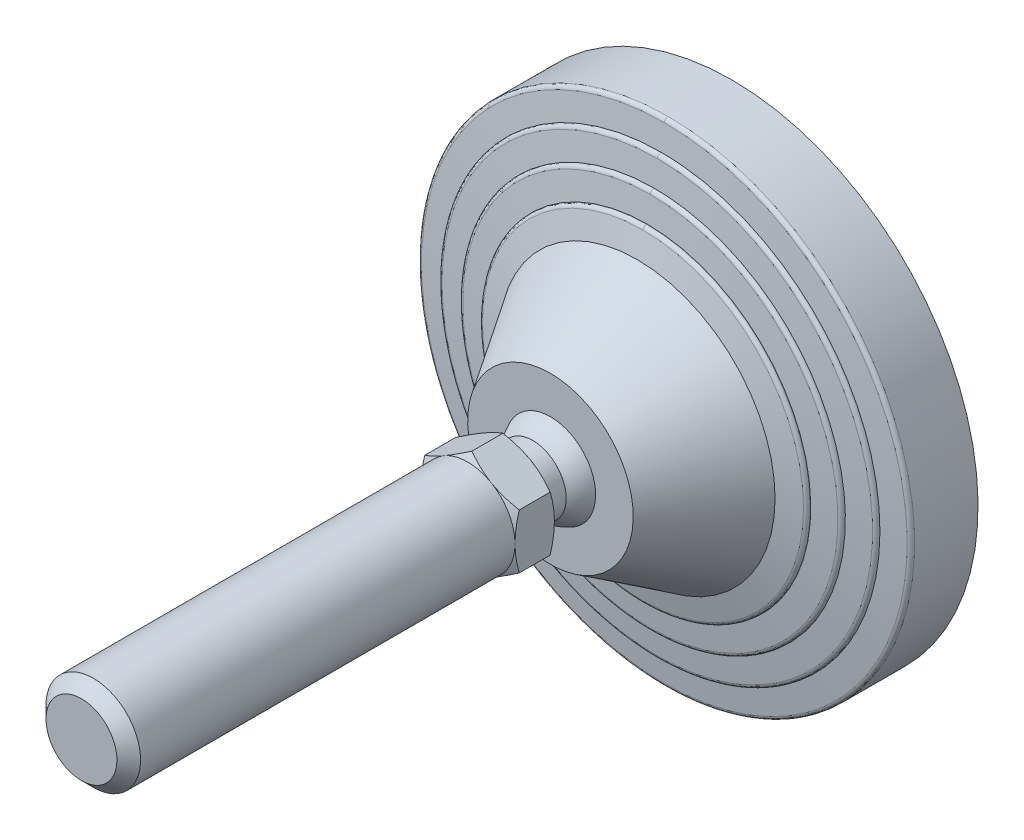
ISO-10303-21;
HEADER;
FILE_DESCRIPTION(('STEP AP214'),'2;1');
FILE_NAME('part.step','',(''),(''),'','','');
FILE_SCHEMA(('AUTOMOTIVE_DESIGN { 1 0 10303 214 1 1 1 1 }'));
ENDSEC;
DATA;
#1=APPLICATION_CONTEXT('core data for automotive mechanical design processes');
#2=APPLICATION_PROTOCOL_DEFINITION('international standard','automotive_design',2000,#1);
#3=PRODUCT_CONTEXT('',#1,'mechanical');
#4=PRODUCT('Part','Part','',(#3));
#5=PRODUCT_RELATED_PRODUCT_CATEGORY('part','',(#4));
#6=PRODUCT_DEFINITION_FORMATION('','',#4);
#7=PRODUCT_DEFINITION_CONTEXT('part definition',#1,'design');
#8=PRODUCT_DEFINITION('design','',#6,#7);
#9=PRODUCT_DEFINITION_SHAPE('','',#8);
#10=(LENGTH_UNIT() NAMED_UNIT(*) SI_UNIT(.MILLI.,.METRE.));
#11=(NAMED_UNIT(*) PLANE_ANGLE_UNIT() SI_UNIT($,.RADIAN.));
#12=(NAMED_UNIT(*) SI_UNIT($,.STERADIAN.) SOLID_ANGLE_UNIT());
#13=UNCERTAINTY_MEASURE_WITH_UNIT(LENGTH_MEASURE(1.E-05),#10,'distance_accuracy_value','');
#14=(GEOMETRIC_REPRESENTATION_CONTEXT(3) GLOBAL_UNCERTAINTY_ASSIGNED_CONTEXT((#13)) GLOBAL_UNIT_ASSIGNED_CONTEXT((#10,
#11,#12)) REPRESENTATION_CONTEXT('',''));
#15=CARTESIAN_POINT('',(0.,0.,0.));
#16=DIRECTION('',(0.,0.,1.));
#17=DIRECTION('',(1.,0.,0.));
#18=AXIS2_PLACEMENT_3D('',#15,#16,#17);
#19=CARTESIAN_POINT('',(-63.467641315,63.25,0.));
#20=DIRECTION('',(0.,0.,1.));
#21=DIRECTION('',(0.,-1.,0.));
#22=AXIS2_PLACEMENT_3D('',#19,#20,#21);
#23=PLANE('',#22);
#24=CARTESIAN_POINT('',(0.,0.,0.));
#25=DIRECTION('',(0.,0.,-1.));
#26=DIRECTION('',(0.,1.,0.));
#27=AXIS2_PLACEMENT_3D('',#24,#25,#26);
#28=CIRCLE('',#27,62.5);
#29=CARTESIAN_POINT('',(0.,62.5,0.));
#30=VERTEX_POINT('',#29);
#31=EDGE_CURVE('E419',#30,#30,#28,.F.);
#32=ORIENTED_EDGE('',*,*,#31,.F.);
#33=EDGE_LOOP('',(#32));
#34=FACE_BOUND('',#33,.T.);
#35=ADVANCED_FACE('F14',(#34),#23,.F.);
#36=CARTESIAN_POINT('',(0.,0.,16.119206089));
#37=DIRECTION('',(0.,0.,-1.));
#38=DIRECTION('',(0.,1.,0.));
#39=AXIS2_PLACEMENT_3D('',#36,#37,#38);
#40=CYLINDRICAL_SURFACE('',#39,62.5);
#41=ORIENTED_EDGE('',*,*,#31,.T.);
#42=EDGE_LOOP('',(#41));
#43=FACE_BOUND('',#42,.T.);
#44=CARTESIAN_POINT('',(0.,0.,16.119206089));
#45=DIRECTION('',(0.,0.,1.));
#46=DIRECTION('',(0.,-1.,0.));
#47=AXIS2_PLACEMENT_3D('',#44,#45,#46);
#48=CIRCLE('',#47,62.5);
#49=CARTESIAN_POINT('',(-6.4094821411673E-09,-62.5,16.119206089));
#50=VERTEX_POINT('',#49);
#51=CARTESIAN_POINT('',(0.,62.5,16.119206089));
#52=VERTEX_POINT('',#51);
#53=EDGE_CURVE('E572',#50,#52,#48,.T.);
#54=ORIENTED_EDGE('',*,*,#53,.F.);
#55=CARTESIAN_POINT('',(0.,0.,16.119206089));
#56=DIRECTION('',(0.,0.,1.));
#57=DIRECTION('',(0.,-1.,0.));
#58=AXIS2_PLACEMENT_3D('',#55,#56,#57);
#59=CIRCLE('',#58,62.5);
#60=EDGE_CURVE('E422',#52,#50,#59,.T.);
#61=ORIENTED_EDGE('',*,*,#60,.F.);
#62=EDGE_LOOP('',(#54,#61));
#63=FACE_BOUND('',#62,.T.);
#64=ADVANCED_FACE('F285',(#43,#63),#40,.T.);
#65=CARTESIAN_POINT('',(0.,-62.5,16.119206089));
#66=CARTESIAN_POINT('',(-125.,-62.5,16.119206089));
#67=CARTESIAN_POINT('',(-125.,62.5,16.119206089));
#68=CARTESIAN_POINT('',(0.,62.5,16.119206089));
#69=CARTESIAN_POINT('',(0.,-62.5,16.647800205));
#70=CARTESIAN_POINT('',(-125.,-62.5000000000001,16.647800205));
#71=CARTESIAN_POINT('',(-125.,62.5000000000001,16.647800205));
#72=CARTESIAN_POINT('',(0.,62.5,16.647800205));
#73=CARTESIAN_POINT('',(0.,-62.150618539,17.044466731));
#74=CARTESIAN_POINT('',(-124.301237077,-62.150618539,17.044466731));
#75=CARTESIAN_POINT('',(-124.301237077,62.150618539,17.044466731));
#76=CARTESIAN_POINT('',(0.,62.150618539,17.044466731));
#77=CARTESIAN_POINT('',(0.,-61.62625428,17.111204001));
#78=CARTESIAN_POINT('',(-123.252508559,-61.6262542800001,17.111204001));
#79=CARTESIAN_POINT('',(-123.252508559,61.6262542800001,17.111204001));
#80=CARTESIAN_POINT('',(0.,61.62625428,17.111204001));
#81=(BOUNDED_SURFACE() B_SPLINE_SURFACE(3,3,((#65,#66,#67,#68),(#69,#70,#71,#72),(#73,#74,#75,
#76),(#77,#78,#79,#80)),.UNSPECIFIED.,.F.,.F.,.F.) B_SPLINE_SURFACE_WITH_KNOTS((4,4),(4,4),(0.,
1.),(0.,1.),.UNSPECIFIED.) GEOMETRIC_REPRESENTATION_ITEM() RATIONAL_B_SPLINE_SURFACE(((1.,
0.333333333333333,0.333333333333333,1.),(0.833611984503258,0.277870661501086,0.277870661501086,
0.833611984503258),(0.833611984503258,0.277870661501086,0.277870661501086,0.833611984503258),
(1.,0.333333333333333,0.333333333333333,1.))) REPRESENTATION_ITEM('') SURFACE());
#82=CARTESIAN_POINT('',(0.,62.5,16.119206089));
#83=CARTESIAN_POINT('',(0.,62.5,16.647800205));
#84=CARTESIAN_POINT('',(0.,62.150618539,17.044466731));
#85=CARTESIAN_POINT('',(0.,61.62625428,17.111204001));
#86=(BOUNDED_CURVE() B_SPLINE_CURVE(3,(#82,#83,#84,#85),.UNSPECIFIED.,.F.,
.F.) B_SPLINE_CURVE_WITH_KNOTS((4,4),(0.,1.),
.UNSPECIFIED.) CURVE() GEOMETRIC_REPRESENTATION_ITEM() RATIONAL_B_SPLINE_CURVE((1.,
0.833611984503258,0.833611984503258,1.)) REPRESENTATION_ITEM(''));
#87=CARTESIAN_POINT('',(0.,61.6262542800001,17.111204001));
#88=VERTEX_POINT('',#87);
#89=EDGE_CURVE('E563',#52,#88,#86,.T.);
#90=CARTESIAN_POINT('',(0.,-62.5,16.119206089));
#91=CARTESIAN_POINT('',(0.,-62.5,16.647800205));
#92=CARTESIAN_POINT('',(0.,-62.150618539,17.044466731));
#93=CARTESIAN_POINT('',(0.,-61.62625428,17.111204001));
#94=(BOUNDED_CURVE() B_SPLINE_CURVE(3,(#90,#91,#92,#93),.UNSPECIFIED.,.F.,
.F.) B_SPLINE_CURVE_WITH_KNOTS((4,4),(0.,1.),
.UNSPECIFIED.) CURVE() GEOMETRIC_REPRESENTATION_ITEM() RATIONAL_B_SPLINE_CURVE((1.,
0.833611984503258,0.833611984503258,1.)) REPRESENTATION_ITEM(''));
#95=CARTESIAN_POINT('',(-1.89596340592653E-08,-61.6262542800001,17.111204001));
#96=VERTEX_POINT('',#95);
#97=EDGE_CURVE('E577',#96,#50,#94,.F.);
#98=CARTESIAN_POINT('',(0.,0.,17.111204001));
#99=DIRECTION('',(0.,0.,-1.));
#100=DIRECTION('',(0.,1.,0.));
#101=AXIS2_PLACEMENT_3D('',#98,#99,#100);
#102=CIRCLE('',#101,61.62625428);
#103=EDGE_CURVE('E556',#88,#96,#102,.F.);
#104=ORIENTED_EDGE('',*,*,#89,.F.);
#105=ORIENTED_EDGE('',*,*,#60,.T.);
#106=ORIENTED_EDGE('',*,*,#97,.F.);
#107=ORIENTED_EDGE('',*,*,#103,.F.);
#108=EDGE_LOOP('',(#104,#105,#106,#107));
#109=FACE_BOUND('',#108,.T.);
#110=ADVANCED_FACE('F923',(#109),#81,.T.);
#111=CARTESIAN_POINT('',(0.,62.5,16.119206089));
#112=CARTESIAN_POINT('',(125.,62.5,16.119206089));
#113=CARTESIAN_POINT('',(125.,-62.5,16.119206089));
#114=CARTESIAN_POINT('',(0.,-62.5,16.119206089));
#115=CARTESIAN_POINT('',(0.,62.5,16.647800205));
#116=CARTESIAN_POINT('',(125.,62.5000000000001,16.647800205));
#117=CARTESIAN_POINT('',(125.,-62.5000000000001,16.647800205));
#118=CARTESIAN_POINT('',(0.,-62.5,16.647800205));
#119=CARTESIAN_POINT('',(0.,62.150618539,17.044466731));
#120=CARTESIAN_POINT('',(124.301237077,62.150618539,17.044466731));
#121=CARTESIAN_POINT('',(124.301237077,-62.150618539,17.044466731));
#122=CARTESIAN_POINT('',(0.,-62.150618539,17.044466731));
#123=CARTESIAN_POINT('',(0.,61.62625428,17.111204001));
#124=CARTESIAN_POINT('',(123.252508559,61.6262542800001,17.111204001));
#125=CARTESIAN_POINT('',(123.252508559,-61.6262542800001,17.111204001));
#126=CARTESIAN_POINT('',(0.,-61.62625428,17.111204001));
#127=(BOUNDED_SURFACE() B_SPLINE_SURFACE(3,3,((#111,#112,#113,#114),(#115,#116,#117,#118),(#119,
#120,#121,#122),(#123,#124,#125,#126)),.UNSPECIFIED.,.F.,.F.,
.F.) B_SPLINE_SURFACE_WITH_KNOTS((4,4),(4,4),(0.,1.),(0.,1.),
.UNSPECIFIED.) GEOMETRIC_REPRESENTATION_ITEM() RATIONAL_B_SPLINE_SURFACE(((1.,0.333333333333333,
0.333333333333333,1.),(0.833611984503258,0.277870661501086,0.277870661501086,0.833611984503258),
(0.833611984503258,0.277870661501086,0.277870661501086,0.833611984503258),(1.,0.333333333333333,
0.333333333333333,1.))) REPRESENTATION_ITEM('') SURFACE());
#128=CARTESIAN_POINT('',(0.,0.,17.111204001));
#129=DIRECTION('',(0.,0.,-1.));
#130=DIRECTION('',(0.,1.,0.));
#131=AXIS2_PLACEMENT_3D('',#128,#129,#130);
#132=CIRCLE('',#131,61.62625428);
#133=EDGE_CURVE('E562',#96,#88,#132,.F.);
#134=ORIENTED_EDGE('',*,*,#53,.T.);
#135=ORIENTED_EDGE('',*,*,#89,.T.);
#136=ORIENTED_EDGE('',*,*,#133,.F.);
#137=ORIENTED_EDGE('',*,*,#97,.T.);
#138=EDGE_LOOP('',(#134,#135,#136,#137));
#139=FACE_BOUND('',#138,.T.);
#140=ADVANCED_FACE('F404',(#139),#127,.T.);
#141=CARTESIAN_POINT('',(0.,0.,17.890909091));
#142=DIRECTION('',(0.,0.,-1.));
#143=DIRECTION('',(0.,1.,0.));
#144=AXIS2_PLACEMENT_3D('',#141,#142,#143);
#145=CONICAL_SURFACE('',#144,55.5,1.44420419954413);
#146=ORIENTED_EDGE('',*,*,#103,.T.);
#147=ORIENTED_EDGE('',*,*,#133,.T.);
#148=EDGE_LOOP('',(#146,#147));
#149=FACE_BOUND('',#148,.T.);
#150=CARTESIAN_POINT('',(-1.13830957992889E-08,-55.5,17.890909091));
#151=CARTESIAN_POINT('',(0.666810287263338,-55.5000058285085,17.890909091));
#152=CARTESIAN_POINT('',(1.33362158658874,-55.4879831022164,17.890909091));
#153=CARTESIAN_POINT('',(2.66828219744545,-55.4398527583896,17.890909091));
#154=CARTESIAN_POINT('',(3.33612903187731,-55.4036764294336,17.890909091));
#155=CARTESIAN_POINT('',(4.67008368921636,-55.3072108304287,17.890909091));
#156=CARTESIAN_POINT('',(5.33619149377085,-55.2469213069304,17.890909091));
#157=CARTESIAN_POINT('',(6.66630694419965,-55.1022519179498,17.890909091));
#158=CARTESIAN_POINT('',(7.33031261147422,-55.0178537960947,17.890909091));
#159=CARTESIAN_POINT('',(8.6548894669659,-54.8250946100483,17.890909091));
#160=CARTESIAN_POINT('',(9.31546019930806,-54.7167304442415,17.890909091));
#161=CARTESIAN_POINT('',(11.3032442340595,-54.3535835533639,17.890909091));
#162=CARTESIAN_POINT('',(12.6239565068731,-54.0621103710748,17.890909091));
#163=CARTESIAN_POINT('',(15.2407929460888,-53.3834839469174,17.890909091));
#164=CARTESIAN_POINT('',(16.5369104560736,-52.9963051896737,17.890909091));
#165=CARTESIAN_POINT('',(19.0989356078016,-52.1278427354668,17.890909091));
#166=CARTESIAN_POINT('',(20.3648068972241,-51.6464516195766,17.890909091));
#167=CARTESIAN_POINT('',(22.8579438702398,-50.5924539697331,17.890909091));
#168=CARTESIAN_POINT('',(24.0852091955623,-50.0198465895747,17.890909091));
#169=CARTESIAN_POINT('',(26.6786676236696,-48.6922162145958,17.890909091));
#170=CARTESIAN_POINT('',(28.0374663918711,-47.922690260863,17.890909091));
#171=CARTESIAN_POINT('',(30.6855194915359,-46.2718474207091,17.890909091));
#172=CARTESIAN_POINT('',(31.9747656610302,-45.3905174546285,17.890909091));
#173=CARTESIAN_POINT('',(34.474552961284,-43.522294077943,17.890909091));
#174=CARTESIAN_POINT('',(35.6850872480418,-42.5353915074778,17.890909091));
#175=CARTESIAN_POINT('',(38.0186685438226,-40.4631409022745,17.890909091));
#176=CARTESIAN_POINT('',(39.1417181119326,-39.3777957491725,17.890909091));
#177=CARTESIAN_POINT('',(41.2923479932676,-37.1163936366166,17.890909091));
#178=CARTESIAN_POINT('',(42.3199319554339,-35.9403401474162,17.890909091));
#179=CARTESIAN_POINT('',(44.2723789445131,-33.5058382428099,17.890909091));
#180=CARTESIAN_POINT('',(45.1972412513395,-32.2473892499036,17.890909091));
#181=CARTESIAN_POINT('',(46.9376312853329,-29.6570957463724,17.890909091));
#182=CARTESIAN_POINT('',(47.7531628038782,-28.3252537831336,17.890909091));
#183=CARTESIAN_POINT('',(49.2691299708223,-25.5976050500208,17.890909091));
#184=CARTESIAN_POINT('',(49.9695658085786,-24.2017983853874,17.890909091));
#185=CARTESIAN_POINT('',(51.2503706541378,-21.3561258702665,17.890909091));
#186=CARTESIAN_POINT('',(51.8307383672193,-19.9062594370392,17.890909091));
#187=CARTESIAN_POINT('',(52.8672716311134,-16.9627885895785,17.890909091));
#188=CARTESIAN_POINT('',(53.3234371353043,-15.4691841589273,17.890909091));
#189=CARTESIAN_POINT('',(54.108327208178,-12.4488388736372,17.890909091));
#190=CARTESIAN_POINT('',(54.437050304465,-10.9220976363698,17.890909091));
#191=CARTESIAN_POINT('',(54.964711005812,-7.8463498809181,17.890909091));
#192=CARTESIAN_POINT('',(55.1636486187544,-6.29734336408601,17.890909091));
#193=CARTESIAN_POINT('',(55.4303245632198,-3.18807153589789,17.890909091));
#194=CARTESIAN_POINT('',(55.4980623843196,-1.6278061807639,17.890909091));
#195=CARTESIAN_POINT('',(55.5018556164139,1.49288460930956,17.890909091));
#196=CARTESIAN_POINT('',(55.4379110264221,3.05331004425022,17.890909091));
#197=CARTESIAN_POINT('',(55.1787965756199,6.16319684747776,17.890909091));
#198=CARTESIAN_POINT('',(54.9836292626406,7.71265842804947,17.890909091));
#199=CARTESIAN_POINT('',(54.4634594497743,10.7896325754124,17.890909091));
#200=CARTESIAN_POINT('',(54.1384569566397,12.3171451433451,17.890909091));
#201=CARTESIAN_POINT('',(53.3609336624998,15.3393372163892,17.890909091));
#202=CARTESIAN_POINT('',(52.9084149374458,16.8340172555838,17.890909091));
#203=CARTESIAN_POINT('',(51.8790738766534,19.7799443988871,17.890909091));
#204=CARTESIAN_POINT('',(51.3022515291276,21.231191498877,17.890909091));
#205=CARTESIAN_POINT('',(50.0283709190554,24.0800097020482,17.890909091));
#206=CARTESIAN_POINT('',(49.3313064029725,25.4775780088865,17.890909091));
#207=CARTESIAN_POINT('',(47.8219174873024,28.2090226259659,17.890909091));
#208=CARTESIAN_POINT('',(47.0095931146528,29.5428989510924,17.890909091));
#209=CARTESIAN_POINT('',(45.2754391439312,32.1375097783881,17.890909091));
#210=CARTESIAN_POINT('',(44.3536065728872,33.3982422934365,17.890909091));
#211=CARTESIAN_POINT('',(42.4069961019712,35.8375708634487,17.890909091));
#212=CARTESIAN_POINT('',(41.3822180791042,37.0161668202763,17.890909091));
#213=CARTESIAN_POINT('',(39.2371577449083,39.2826945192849,17.890909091));
#214=CARTESIAN_POINT('',(38.1168855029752,40.3706357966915,17.890909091));
#215=CARTESIAN_POINT('',(35.7885615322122,42.4483529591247,17.890909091));
#216=CARTESIAN_POINT('',(34.5805102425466,43.4381293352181,17.890909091));
#217=CARTESIAN_POINT('',(32.5014047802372,44.9999063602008,17.890909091));
#218=CARTESIAN_POINT('',(31.652185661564,45.6012216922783,17.890909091));
#219=CARTESIAN_POINT('',(29.9212415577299,46.7552239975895,17.890909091));
#220=CARTESIAN_POINT('',(29.0395163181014,47.3079105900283,17.890909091));
#221=CARTESIAN_POINT('',(27.2463975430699,48.3628576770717,17.890909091));
#222=CARTESIAN_POINT('',(26.3350034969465,48.8651173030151,17.890909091));
#223=CARTESIAN_POINT('',(24.4853750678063,49.8176528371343,17.890909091));
#224=CARTESIAN_POINT('',(23.5471392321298,50.2679259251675,17.890909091));
#225=CARTESIAN_POINT('',(21.6468644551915,51.1150215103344,17.890909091));
#226=CARTESIAN_POINT('',(20.6848259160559,51.5118449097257,17.890909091));
#227=CARTESIAN_POINT('',(18.7400290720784,52.2507726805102,17.890909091));
#228=CARTESIAN_POINT('',(17.7572723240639,52.5928811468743,17.890909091));
#229=CARTESIAN_POINT('',(15.863617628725,53.1929617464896,17.890909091));
#230=CARTESIAN_POINT('',(14.9542390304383,53.4557406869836,17.890909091));
#231=CARTESIAN_POINT('',(13.1232854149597,53.9344479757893,17.890909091));
#232=CARTESIAN_POINT('',(12.2017111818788,54.1503793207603,17.890909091));
#233=CARTESIAN_POINT('',(10.348755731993,54.5348378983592,17.890909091));
#234=CARTESIAN_POINT('',(9.41737477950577,54.7033664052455,17.890909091));
#235=CARTESIAN_POINT('',(7.54728204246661,54.9925789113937,17.890909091));
#236=CARTESIAN_POINT('',(6.60857079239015,55.1132663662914,17.890909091));
#237=CARTESIAN_POINT('',(4.72616569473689,55.3064952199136,17.890909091));
#238=CARTESIAN_POINT('',(3.78247163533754,55.379034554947,17.890909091));
#239=CARTESIAN_POINT('',(1.89251924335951,55.4758006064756,17.890909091));
#240=CARTESIAN_POINT('',(0.946260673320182,55.5000226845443,17.890909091));
#241=CARTESIAN_POINT('',(-1.66116448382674E-09,55.5,17.890909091));
#242=B_SPLINE_CURVE_WITH_KNOTS('',3,(#150,#151,#152,#153,#154,#155,#156,#157,#158,#159,#160,
#161,#162,#163,#164,#165,#166,#167,#168,#169,#170,#171,#172,#173,#174,#175,#176,#177,#178,#179,
#180,#181,#182,#183,#184,#185,#186,#187,#188,#189,#190,#191,#192,#193,#194,#195,#196,#197,#198,
#199,#200,#201,#202,#203,#204,#205,#206,#207,#208,#209,#210,#211,#212,#213,#214,#215,#216,#217,
#218,#219,#220,#221,#222,#223,#224,#225,#226,#227,#228,#229,#230,#231,#232,#233,#234,#235,#236,
#237,#238,#239,#240,#241),.UNSPECIFIED.,.F.,.F.,(4,2,2,2,2,2,2,2,2,2,2,2,2,2,2,2,2,2,2,2,2,2,2,
2,2,2,2,2,2,2,2,2,2,2,2,2,2,2,2,2,2,2,2,2,2,4),(0.,2.00032482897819,4.00636450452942,
6.01242526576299,8.02000917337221,10.0278530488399,14.0813911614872,18.1360111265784,
22.1952813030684,26.2545891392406,30.9336173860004,35.6131935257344,40.2931760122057,
44.973021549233,49.6526881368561,54.3323875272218,59.0119245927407,63.6914539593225,
68.3710337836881,73.0506153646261,77.7302510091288,82.409886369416,87.0895399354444,
91.7691935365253,96.4487562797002,101.128318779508,105.807805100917,110.487291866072,
115.167022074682,119.846751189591,124.526607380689,129.206469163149,133.88583808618,
138.565183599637,141.685351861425,144.805544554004,147.925790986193,151.04620660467,
154.166569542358,157.286698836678,160.125236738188,162.963593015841,165.801872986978,
168.639947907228,171.478144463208,174.316613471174),.UNSPECIFIED.);
#243=CARTESIAN_POINT('',(-1.13832320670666E-08,-55.5,17.895966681));
#244=VERTEX_POINT('',#243);
#245=CARTESIAN_POINT('',(-1.6611821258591E-09,55.5,17.895966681));
#246=VERTEX_POINT('',#245);
#247=EDGE_CURVE('E385',#244,#246,#242,.T.);
#248=ORIENTED_EDGE('',*,*,#247,.F.);
#249=CARTESIAN_POINT('',(-1.66117986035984E-09,55.5,17.890909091));
#250=CARTESIAN_POINT('',(-0.666810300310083,55.5000058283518,17.890909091));
#251=CARTESIAN_POINT('',(-1.33362159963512,55.4879831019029,17.890909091));
#252=CARTESIAN_POINT('',(-2.66828221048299,55.4398527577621,17.890909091));
#253=CARTESIAN_POINT('',(-3.33612904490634,55.403676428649,17.890909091));
#254=CARTESIAN_POINT('',(-4.6700837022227,55.3072108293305,17.890909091));
#255=CARTESIAN_POINT('',(-5.33619150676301,55.2469213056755,17.890909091));
#256=CARTESIAN_POINT('',(-6.6663069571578,55.1022519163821,17.890909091));
#257=CARTESIAN_POINT('',(-7.33031262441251,55.0178537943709,17.890909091));
#258=CARTESIAN_POINT('',(-8.65488947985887,54.825094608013,17.890909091));
#259=CARTESIAN_POINT('',(-9.31546021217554,54.7167304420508,17.890909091));
#260=CARTESIAN_POINT('',(-11.3032442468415,54.3535835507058,17.890909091));
#261=CARTESIAN_POINT('',(-12.6239565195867,54.062110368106,17.890909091));
#262=CARTESIAN_POINT('',(-15.2407929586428,53.3834839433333,17.890909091));
#263=CARTESIAN_POINT('',(-16.5369104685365,52.9963051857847,17.890909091));
#264=CARTESIAN_POINT('',(-19.0989356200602,52.1278427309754,17.890909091));
#265=CARTESIAN_POINT('',(-20.3648069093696,51.6464516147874,17.890909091));
#266=CARTESIAN_POINT('',(-22.8579438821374,50.5924539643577,17.890909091));
#267=CARTESIAN_POINT('',(-24.0852092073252,50.0198465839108,17.890909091));
#268=CARTESIAN_POINT('',(-26.6786676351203,48.692216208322,17.890909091));
#269=CARTESIAN_POINT('',(-28.0374664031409,47.9226902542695,17.890909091));
#270=CARTESIAN_POINT('',(-30.6855195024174,46.271847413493,17.890909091));
#271=CARTESIAN_POINT('',(-31.9747656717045,45.3905174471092,17.890909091));
#272=CARTESIAN_POINT('',(-34.4745529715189,43.5222940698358,17.890909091));
#273=CARTESIAN_POINT('',(-35.6850872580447,42.5353914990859,17.890909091));
#274=CARTESIAN_POINT('',(-38.0186685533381,40.4631408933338,17.890909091));
#275=CARTESIAN_POINT('',(-39.1417181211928,39.3777957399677,17.890909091));
#276=CARTESIAN_POINT('',(-41.292348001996,37.1163936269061,17.890909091));
#277=CARTESIAN_POINT('',(-42.3199319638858,35.9403401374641,17.890909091));
#278=CARTESIAN_POINT('',(-44.2723789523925,33.5058382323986,17.890909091));
#279=CARTESIAN_POINT('',(-45.197241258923,32.2473892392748,17.890909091));
#280=CARTESIAN_POINT('',(-46.9376312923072,29.6570957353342,17.890909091));
#281=CARTESIAN_POINT('',(-47.7531628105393,28.3252537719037,17.890909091));
#282=CARTESIAN_POINT('',(-49.269129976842,25.5976050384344,17.890909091));
#283=CARTESIAN_POINT('',(-49.9695658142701,24.2017983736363,17.890909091));
#284=CARTESIAN_POINT('',(-51.2503706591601,21.3561258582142,17.890909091));
#285=CARTESIAN_POINT('',(-51.8307383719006,19.9062594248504,17.890909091));
#286=CARTESIAN_POINT('',(-52.8672716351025,16.9627885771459,17.890909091));
#287=CARTESIAN_POINT('',(-53.3234371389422,15.4691841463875,17.890909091));
#288=CARTESIAN_POINT('',(-54.1083272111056,12.4488388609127,17.890909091));
#289=CARTESIAN_POINT('',(-54.4370503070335,10.9220976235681,17.890909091));
#290=CARTESIAN_POINT('',(-54.9647110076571,7.84634986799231,17.890909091));
#291=CARTESIAN_POINT('',(-55.1636486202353,6.29734335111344,17.890909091));
#292=CARTESIAN_POINT('',(-55.4303245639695,3.18807152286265,17.890909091));
#293=CARTESIAN_POINT('',(-55.4980623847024,1.62780616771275,17.890909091));
#294=CARTESIAN_POINT('',(-55.5018556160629,-1.49288462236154,17.890909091));
#295=CARTESIAN_POINT('',(-55.437911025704,-3.05331005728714,17.890909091));
#296=CARTESIAN_POINT('',(-55.1787965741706,-6.16319686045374,17.890909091));
#297=CARTESIAN_POINT('',(-54.9836292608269,-7.71265844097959,17.890909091));
#298=CARTESIAN_POINT('',(-54.463459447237,-10.7896325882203,17.890909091));
#299=CARTESIAN_POINT('',(-54.1384569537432,-12.3171451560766,17.890909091));
#300=CARTESIAN_POINT('',(-53.3609336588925,-15.339337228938,17.890909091));
#301=CARTESIAN_POINT('',(-52.9084149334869,-16.8340172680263,17.890909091));
#302=CARTESIAN_POINT('',(-51.8790738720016,-19.7799444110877,17.890909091));
#303=CARTESIAN_POINT('',(-51.3022515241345,-21.2311915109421,17.890909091));
#304=CARTESIAN_POINT('',(-50.0283709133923,-24.0800097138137,17.890909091));
#305=CARTESIAN_POINT('',(-49.3313063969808,-25.477578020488,17.890909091));
#306=CARTESIAN_POINT('',(-47.8219174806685,-28.2090226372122,17.890909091));
#307=CARTESIAN_POINT('',(-47.0095931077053,-29.5428989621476,17.890909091));
#308=CARTESIAN_POINT('',(-45.2754391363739,-32.1375097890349,17.890909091));
#309=CARTESIAN_POINT('',(-44.3536065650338,-33.398242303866,17.890909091));
#310=CARTESIAN_POINT('',(-42.4069960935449,-35.8375708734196,17.890909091));
#311=CARTESIAN_POINT('',(-41.3822180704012,-37.0161668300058,17.890909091));
#312=CARTESIAN_POINT('',(-39.2371577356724,-39.2826945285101,17.890909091));
#313=CARTESIAN_POINT('',(-38.1168854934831,-40.3706358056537,17.890909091));
#314=CARTESIAN_POINT('',(-35.7885615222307,-42.4483529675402,17.890909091));
#315=CARTESIAN_POINT('',(-34.5805102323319,-43.4381293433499,17.890909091));
#316=CARTESIAN_POINT('',(-32.5014047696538,-44.9999063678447,17.890909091));
#317=CARTESIAN_POINT('',(-31.6521856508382,-45.6012216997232,17.890909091));
#318=CARTESIAN_POINT('',(-29.9212415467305,-46.7552240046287,17.890909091));
#319=CARTESIAN_POINT('',(-29.0395163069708,-47.3079105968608,17.890909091));
#320=CARTESIAN_POINT('',(-27.2463975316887,-48.3628576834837,17.890909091));
#321=CARTESIAN_POINT('',(-26.3350034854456,-48.8651173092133,17.890909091));
#322=CARTESIAN_POINT('',(-24.4853750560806,-49.8176528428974,17.890909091));
#323=CARTESIAN_POINT('',(-23.5471392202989,-50.2679259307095,17.890909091));
#324=CARTESIAN_POINT('',(-21.6468644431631,-51.1150215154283,17.890909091));
#325=CARTESIAN_POINT('',(-20.6848259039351,-51.5118449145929,17.890909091));
#326=CARTESIAN_POINT('',(-18.7400290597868,-52.2507726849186,17.890909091));
#327=CARTESIAN_POINT('',(-17.7572723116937,-52.5928811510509,17.890909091));
#328=CARTESIAN_POINT('',(-15.8636176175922,-53.192961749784,17.890909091));
#329=CARTESIAN_POINT('',(-14.9542390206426,-53.4557406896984,17.890909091));
#330=CARTESIAN_POINT('',(-13.1232854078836,-53.9344479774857,17.890909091));
#331=CARTESIAN_POINT('',(-12.2017111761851,-54.150379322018,17.890909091));
#332=CARTESIAN_POINT('',(-10.3487557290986,-54.5348378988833,17.890909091));
#333=CARTESIAN_POINT('',(-9.41737477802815,-54.7033664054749,17.890909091));
#334=CARTESIAN_POINT('',(-7.54728204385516,-54.9925789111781,17.890909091));
#335=CARTESIAN_POINT('',(-6.60857079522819,-55.1132663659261,17.890909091));
#336=CARTESIAN_POINT('',(-4.72616570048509,-55.3064952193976,17.890909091));
#337=CARTESIAN_POINT('',(-3.7824716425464,-55.3790345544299,17.890909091));
#338=CARTESIAN_POINT('',(-1.89251925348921,-55.4758006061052,17.890909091));
#339=CARTESIAN_POINT('',(-0.946260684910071,-55.5000226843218,17.890909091));
#340=CARTESIAN_POINT('',(-1.13832302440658E-08,-55.5,17.890909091));
#341=B_SPLINE_CURVE_WITH_KNOTS('',3,(#249,#250,#251,#252,#253,#254,#255,#256,#257,#258,#259,
#260,#261,#262,#263,#264,#265,#266,#267,#268,#269,#270,#271,#272,#273,#274,#275,#276,#277,#278,
#279,#280,#281,#282,#283,#284,#285,#286,#287,#288,#289,#290,#291,#292,#293,#294,#295,#296,#297,
#298,#299,#300,#301,#302,#303,#304,#305,#306,#307,#308,#309,#310,#311,#312,#313,#314,#315,#316,
#317,#318,#319,#320,#321,#322,#323,#324,#325,#326,#327,#328,#329,#330,#331,#332,#333,#334,#335,
#336,#337,#338,#339,#340),.UNSPECIFIED.,.F.,.F.,(4,2,2,2,2,2,2,2,2,2,2,2,2,2,2,2,2,2,2,2,2,2,2,
2,2,2,2,2,2,2,2,2,2,2,2,2,2,2,2,2,2,2,2,2,2,4),(0.,2.00032482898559,4.00636450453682,
6.0124252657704,8.02000917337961,10.0278530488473,14.0813911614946,18.1360111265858,
22.1952813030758,26.254589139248,30.9336173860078,35.6131935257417,40.293176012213,
44.9730215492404,49.6526881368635,54.3323875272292,59.0119245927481,63.69145395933,
68.3710337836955,73.0506153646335,77.7302510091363,82.4098863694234,87.0895399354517,
91.7691935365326,96.4487562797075,101.128318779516,105.807805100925,110.48729186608,
115.16702207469,119.846751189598,124.526607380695,129.206469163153,133.885838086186,
138.565183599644,141.685351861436,144.805544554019,147.925790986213,151.046206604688,
154.166569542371,157.286698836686,160.125236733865,162.963593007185,165.801872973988,
168.639947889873,171.478144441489,174.316613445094),.UNSPECIFIED.);
#342=EDGE_CURVE('E397',#246,#244,#341,.T.);
#343=ORIENTED_EDGE('',*,*,#342,.F.);
#344=EDGE_LOOP('',(#248,#343));
#345=FACE_BOUND('',#344,.T.);
#346=ADVANCED_FACE('F399',(#149,#345),#145,.T.);
#347=CARTESIAN_POINT('',(0.,-55.5,17.887804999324));
#348=CARTESIAN_POINT('',(-111.,-55.5000000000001,17.8878049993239));
#349=CARTESIAN_POINT('',(-111.,55.5000000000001,17.8878049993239));
#350=CARTESIAN_POINT('',(0.,55.5,17.887804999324));
#351=CARTESIAN_POINT('',(0.,-55.5,17.892211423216));
#352=CARTESIAN_POINT('',(-111.,-55.5000000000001,17.892211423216));
#353=CARTESIAN_POINT('',(-111.,55.5000000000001,17.892211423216));
#354=CARTESIAN_POINT('',(0.,55.5,17.892211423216));
#355=CARTESIAN_POINT('',(0.,-55.5,17.896617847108));
#356=CARTESIAN_POINT('',(-111.,-55.5000000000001,17.896617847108));
#357=CARTESIAN_POINT('',(-111.,55.5000000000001,17.896617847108));
#358=CARTESIAN_POINT('',(0.,55.5,17.896617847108));
#359=CARTESIAN_POINT('',(0.,-55.5,17.901024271));
#360=CARTESIAN_POINT('',(-111.,-55.5000000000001,17.901024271));
#361=CARTESIAN_POINT('',(-111.,55.5000000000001,17.901024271));
#362=CARTESIAN_POINT('',(0.,55.5,17.901024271));
#363=CARTESIAN_POINT('',(0.,-55.5,18.429618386));
#364=CARTESIAN_POINT('',(-111.,-55.5,18.429618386));
#365=CARTESIAN_POINT('',(-111.,55.5,18.429618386));
#366=CARTESIAN_POINT('',(0.,55.5,18.429618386));
#367=CARTESIAN_POINT('',(0.,-55.150618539,18.826284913));
#368=CARTESIAN_POINT('',(-110.301237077,-55.150618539,18.826284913));
#369=CARTESIAN_POINT('',(-110.301237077,55.150618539,18.826284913));
#370=CARTESIAN_POINT('',(0.,55.150618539,18.826284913));
#371=CARTESIAN_POINT('',(0.,-54.62625428,18.893022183));
#372=CARTESIAN_POINT('',(-109.252508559,-54.62625428,18.893022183));
#373=CARTESIAN_POINT('',(-109.252508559,54.62625428,18.893022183));
#374=CARTESIAN_POINT('',(0.,54.62625428,18.893022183));
#375=(BOUNDED_SURFACE() B_SPLINE_SURFACE(3,3,((#347,#348,#349,#350),(#351,#352,#353,#354),(#355,
#356,#357,#358),(#359,#360,#361,#362),(#363,#364,#365,#366),(#367,#368,#369,#370),(#371,#372,
#373,#374)),.UNSPECIFIED.,.F.,.F.,.F.) B_SPLINE_SURFACE_WITH_KNOTS((4,3,4),(4,4),(-0.01,0.,1.),
(0.,1.),.UNSPECIFIED.) GEOMETRIC_REPRESENTATION_ITEM() RATIONAL_B_SPLINE_SURFACE(((1.,
0.333333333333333,0.333333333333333,1.),(1.,0.333333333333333,0.333333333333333,1.),(1.,
0.333333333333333,0.333333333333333,1.),(1.,0.333333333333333,0.333333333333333,1.),
(0.833611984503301,0.277870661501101,0.277870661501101,0.833611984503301),(0.833611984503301,
0.277870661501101,0.277870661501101,0.833611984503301),(1.,0.333333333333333,0.333333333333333,1.))) REPRESENTATION_ITEM('') SURFACE());
#376=CARTESIAN_POINT('',(0.,55.5,17.901024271));
#377=CARTESIAN_POINT('',(0.,55.5,18.429618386));
#378=CARTESIAN_POINT('',(0.,55.150618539,18.826284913));
#379=CARTESIAN_POINT('',(0.,54.62625428,18.893022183));
#380=(BOUNDED_CURVE() B_SPLINE_CURVE(3,(#376,#377,#378,#379),.UNSPECIFIED.,.F.,
.F.) B_SPLINE_CURVE_WITH_KNOTS((4,4),(0.,1.),
.UNSPECIFIED.) CURVE() GEOMETRIC_REPRESENTATION_ITEM() RATIONAL_B_SPLINE_CURVE((1.,
0.833611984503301,0.833611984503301,1.)) REPRESENTATION_ITEM(''));
#381=CARTESIAN_POINT('',(0.,54.6262542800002,18.8930221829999));
#382=VERTEX_POINT('',#381);
#383=EDGE_CURVE('E388',#246,#382,#380,.T.);
#384=CARTESIAN_POINT('',(0.,-55.5,17.901024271));
#385=CARTESIAN_POINT('',(0.,-55.5,18.429618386));
#386=CARTESIAN_POINT('',(0.,-55.150618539,18.826284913));
#387=CARTESIAN_POINT('',(0.,-54.62625428,18.893022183));
#388=(BOUNDED_CURVE() B_SPLINE_CURVE(3,(#384,#385,#386,#387),.UNSPECIFIED.,.F.,
.F.) B_SPLINE_CURVE_WITH_KNOTS((4,4),(0.,1.),
.UNSPECIFIED.) CURVE() GEOMETRIC_REPRESENTATION_ITEM() RATIONAL_B_SPLINE_CURVE((1.,
0.833611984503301,0.833611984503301,1.)) REPRESENTATION_ITEM(''));
#389=CARTESIAN_POINT('',(-1.68060480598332E-08,-54.6262542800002,18.8930221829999));
#390=VERTEX_POINT('',#389);
#391=EDGE_CURVE('E389',#390,#244,#388,.F.);
#392=CARTESIAN_POINT('',(0.,0.,18.8930221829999));
#393=DIRECTION('',(0.,0.,-1.));
#394=DIRECTION('',(0.,1.,0.));
#395=AXIS2_PLACEMENT_3D('',#392,#393,#394);
#396=CIRCLE('',#395,54.62625428);
#397=EDGE_CURVE('E528',#382,#390,#396,.F.);
#398=ORIENTED_EDGE('',*,*,#383,.F.);
#399=ORIENTED_EDGE('',*,*,#342,.T.);
#400=ORIENTED_EDGE('',*,*,#391,.F.);
#401=ORIENTED_EDGE('',*,*,#397,.F.);
#402=EDGE_LOOP('',(#398,#399,#400,#401));
#403=FACE_BOUND('',#402,.T.);
#404=ADVANCED_FACE('F403',(#403),#375,.T.);
#405=CARTESIAN_POINT('',(0.,55.5,17.887804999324));
#406=CARTESIAN_POINT('',(111.,55.5000000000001,17.8878049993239));
#407=CARTESIAN_POINT('',(111.,-55.5000000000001,17.8878049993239));
#408=CARTESIAN_POINT('',(0.,-55.5,17.887804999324));
#409=CARTESIAN_POINT('',(0.,55.5,17.892211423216));
#410=CARTESIAN_POINT('',(111.,55.5000000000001,17.892211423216));
#411=CARTESIAN_POINT('',(111.,-55.5000000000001,17.892211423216));
#412=CARTESIAN_POINT('',(0.,-55.5,17.892211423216));
#413=CARTESIAN_POINT('',(0.,55.5,17.896617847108));
#414=CARTESIAN_POINT('',(111.,55.5000000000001,17.896617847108));
#415=CARTESIAN_POINT('',(111.,-55.5000000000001,17.896617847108));
#416=CARTESIAN_POINT('',(0.,-55.5,17.896617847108));
#417=CARTESIAN_POINT('',(0.,55.5,17.901024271));
#418=CARTESIAN_POINT('',(111.,55.5000000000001,17.901024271));
#419=CARTESIAN_POINT('',(111.,-55.5000000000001,17.901024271));
#420=CARTESIAN_POINT('',(0.,-55.5,17.901024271));
#421=CARTESIAN_POINT('',(0.,55.5,18.429618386));
#422=CARTESIAN_POINT('',(111.,55.5,18.429618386));
#423=CARTESIAN_POINT('',(111.,-55.5,18.429618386));
#424=CARTESIAN_POINT('',(0.,-55.5,18.429618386));
#425=CARTESIAN_POINT('',(0.,55.150618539,18.826284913));
#426=CARTESIAN_POINT('',(110.301237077,55.150618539,18.826284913));
#427=CARTESIAN_POINT('',(110.301237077,-55.150618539,18.826284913));
#428=CARTESIAN_POINT('',(0.,-55.150618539,18.826284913));
#429=CARTESIAN_POINT('',(0.,54.62625428,18.893022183));
#430=CARTESIAN_POINT('',(109.252508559,54.62625428,18.893022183));
#431=CARTESIAN_POINT('',(109.252508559,-54.62625428,18.893022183));
#432=CARTESIAN_POINT('',(0.,-54.62625428,18.893022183));
#433=(BOUNDED_SURFACE() B_SPLINE_SURFACE(3,3,((#405,#406,#407,#408),(#409,#410,#411,#412),(#413,
#414,#415,#416),(#417,#418,#419,#420),(#421,#422,#423,#424),(#425,#426,#427,#428),(#429,#430,
#431,#432)),.UNSPECIFIED.,.F.,.F.,.F.) B_SPLINE_SURFACE_WITH_KNOTS((4,3,4),(4,4),(-0.01,0.,1.),
(0.,1.),.UNSPECIFIED.) GEOMETRIC_REPRESENTATION_ITEM() RATIONAL_B_SPLINE_SURFACE(((1.,
0.333333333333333,0.333333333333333,1.),(1.,0.333333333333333,0.333333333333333,1.),(1.,
0.333333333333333,0.333333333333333,1.),(1.,0.333333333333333,0.333333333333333,1.),
(0.833611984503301,0.277870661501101,0.277870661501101,0.833611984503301),(0.833611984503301,
0.277870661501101,0.277870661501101,0.833611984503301),(1.,0.333333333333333,0.333333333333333,1.))) REPRESENTATION_ITEM('') SURFACE());
#434=CARTESIAN_POINT('',(0.,0.,18.8930221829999));
#435=DIRECTION('',(0.,0.,-1.));
#436=DIRECTION('',(0.,1.,0.));
#437=AXIS2_PLACEMENT_3D('',#434,#435,#436);
#438=CIRCLE('',#437,54.62625428);
#439=EDGE_CURVE('E534',#390,#382,#438,.F.);
#440=ORIENTED_EDGE('',*,*,#247,.T.);
#441=ORIENTED_EDGE('',*,*,#383,.T.);
#442=ORIENTED_EDGE('',*,*,#439,.F.);
#443=ORIENTED_EDGE('',*,*,#391,.T.);
#444=EDGE_LOOP('',(#440,#441,#442,#443));
#445=FACE_BOUND('',#444,.T.);
#446=ADVANCED_FACE('F372',(#445),#433,.T.);
#447=CARTESIAN_POINT('',(0.,0.,19.672727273));
#448=DIRECTION('',(0.,0.,-1.));
#449=DIRECTION('',(0.,1.,0.));
#450=AXIS2_PLACEMENT_3D('',#447,#448,#449);
#451=CONICAL_SURFACE('',#450,48.5,1.44420419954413);
#452=ORIENTED_EDGE('',*,*,#397,.T.);
#453=ORIENTED_EDGE('',*,*,#439,.T.);
#454=EDGE_LOOP('',(#452,#453));
#455=FACE_BOUND('',#454,.T.);
#456=CARTESIAN_POINT('',(-9.9473684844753E-09,-48.5,19.672727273));
#457=CARTESIAN_POINT('',(0.333415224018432,-48.4999999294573,19.672727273));
#458=CARTESIAN_POINT('',(0.666820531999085,-48.4965617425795,19.672727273));
#459=CARTESIAN_POINT('',(1.33352786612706,-48.4828103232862,19.672727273));
#460=CARTESIAN_POINT('',(1.666829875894,-48.4724962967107,19.672727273));
#461=CARTESIAN_POINT('',(2.66872204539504,-48.4311451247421,19.672727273));
#462=CARTESIAN_POINT('',(3.33691272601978,-48.3896987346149,19.672727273));
#463=CARTESIAN_POINT('',(4.67104276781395,-48.2791827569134,19.672727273));
#464=CARTESIAN_POINT('',(5.33698191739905,-48.2101106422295,19.672727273));
#465=CARTESIAN_POINT('',(6.66612914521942,-48.0443714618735,19.672727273));
#466=CARTESIAN_POINT('',(7.32933372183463,-47.9476761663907,19.672727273));
#467=CARTESIAN_POINT('',(8.65121670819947,-47.7268868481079,19.672727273));
#468=CARTESIAN_POINT('',(9.30989445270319,-47.6027888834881,19.672727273));
#469=CARTESIAN_POINT('',(11.2942742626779,-47.1861322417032,19.672727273));
#470=CARTESIAN_POINT('',(12.6113745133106,-46.8513167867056,19.672727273));
#471=CARTESIAN_POINT('',(15.2131663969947,-46.0722804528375,19.672727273));
#472=CARTESIAN_POINT('',(16.4978453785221,-45.628017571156,19.672727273));
#473=CARTESIAN_POINT('',(19.0268967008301,-44.6326754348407,19.672727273));
#474=CARTESIAN_POINT('',(20.2712210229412,-44.0814740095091,19.672727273));
#475=CARTESIAN_POINT('',(22.7090353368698,-42.8765478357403,19.672727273));
#476=CARTESIAN_POINT('',(23.9025301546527,-42.2228328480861,19.672727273));
#477=CARTESIAN_POINT('',(26.2339069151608,-40.8153372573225,19.672727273));
#478=CARTESIAN_POINT('',(27.371610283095,-40.0612608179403,19.672727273));
#479=CARTESIAN_POINT('',(29.5794657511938,-38.4599142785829,19.672727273));
#480=CARTESIAN_POINT('',(30.6496160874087,-37.6126417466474,19.672727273));
#481=CARTESIAN_POINT('',(32.714431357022,-35.8311972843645,19.672727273));
#482=CARTESIAN_POINT('',(33.7091176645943,-34.8970501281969,19.672727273));
#483=CARTESIAN_POINT('',(35.6162650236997,-32.9482983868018,19.672727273));
#484=CARTESIAN_POINT('',(36.5287266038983,-31.9336943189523,19.672727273));
#485=CARTESIAN_POINT('',(38.2650470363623,-29.8311130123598,19.672727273));
#486=CARTESIAN_POINT('',(39.0888956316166,-28.7431273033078,19.672727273));
#487=CARTESIAN_POINT('',(40.6420135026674,-26.5016202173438,19.672727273));
#488=CARTESIAN_POINT('',(41.3712826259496,-25.3480987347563,19.672727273));
#489=CARTESIAN_POINT('',(42.7300878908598,-22.9836659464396,19.672727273));
#490=CARTESIAN_POINT('',(43.3596192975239,-21.7727519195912,19.672727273));
#491=CARTESIAN_POINT('',(44.5144313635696,-19.3021944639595,19.672727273));
#492=CARTESIAN_POINT('',(45.0397120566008,-18.042551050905,19.672727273));
#493=CARTESIAN_POINT('',(45.9822772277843,-15.4835203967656,19.672727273));
#494=CARTESIAN_POINT('',(46.3995642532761,-14.184134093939,19.672727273));
#495=CARTESIAN_POINT('',(47.1231916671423,-11.5548271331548,19.672727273));
#496=CARTESIAN_POINT('',(47.4295320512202,-10.2249064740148,19.672727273));
#497=CARTESIAN_POINT('',(47.9290880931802,-7.54398668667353,19.672727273));
#498=CARTESIAN_POINT('',(48.1223038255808,-6.19298757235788,19.672727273));
#499=CARTESIAN_POINT('',(48.3942372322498,-3.47951480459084,19.672727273));
#500=CARTESIAN_POINT('',(48.4729549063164,-2.11704115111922,19.672727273));
#501=CARTESIAN_POINT('',(48.5153327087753,0.609703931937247,19.672727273));
#502=CARTESIAN_POINT('',(48.4789920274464,1.97397537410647,19.672727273));
#503=CARTESIAN_POINT('',(48.2915097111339,4.6946071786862,19.672727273));
#504=CARTESIAN_POINT('',(48.1403680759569,6.05096754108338,19.672727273));
#505=CARTESIAN_POINT('',(47.7243611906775,8.74611604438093,19.672727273));
#506=CARTESIAN_POINT('',(47.45949746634,10.0849044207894,19.672727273));
#507=CARTESIAN_POINT('',(46.8179296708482,12.7354096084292,19.672727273));
#508=CARTESIAN_POINT('',(46.441225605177,14.0471264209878,19.672727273));
#509=CARTESIAN_POINT('',(45.5786575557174,16.6341561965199,19.672727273));
#510=CARTESIAN_POINT('',(45.0927941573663,17.9094693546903,19.672727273));
#511=CARTESIAN_POINT('',(44.0153602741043,20.4146329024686,19.672727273));
#512=CARTESIAN_POINT('',(43.4237897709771,21.644483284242,19.672727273));
#513=CARTESIAN_POINT('',(42.1391318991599,24.050006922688,19.672727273));
#514=CARTESIAN_POINT('',(41.4460420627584,25.2256788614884,19.672727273));
#515=CARTESIAN_POINT('',(39.9632836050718,27.5144547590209,19.672727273));
#516=CARTESIAN_POINT('',(39.1736150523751,28.6275587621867,19.672727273));
#517=CARTESIAN_POINT('',(37.5033313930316,30.7832641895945,19.672727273));
#518=CARTESIAN_POINT('',(36.6227180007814,31.8258669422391,19.672727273));
#519=CARTESIAN_POINT('',(34.7767800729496,33.8331893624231,19.672727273));
#520=CARTESIAN_POINT('',(33.8114552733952,34.797908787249,19.672727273));
#521=CARTESIAN_POINT('',(31.8029804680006,36.6425966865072,19.672727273));
#522=CARTESIAN_POINT('',(30.7598292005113,37.5225637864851,19.672727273));
#523=CARTESIAN_POINT('',(28.6030073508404,39.1915394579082,19.672727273));
#524=CARTESIAN_POINT('',(27.4893376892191,39.9805492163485,19.672727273));
#525=CARTESIAN_POINT('',(25.5812150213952,41.215030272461,19.672727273));
#526=CARTESIAN_POINT('',(24.8040020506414,41.6873877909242,19.672727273));
#527=CARTESIAN_POINT('',(23.2241951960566,42.5877109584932,19.672727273));
#528=CARTESIAN_POINT('',(22.4216008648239,43.0156758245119,19.672727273));
#529=CARTESIAN_POINT('',(20.7935946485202,43.8258285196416,19.672727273));
#530=CARTESIAN_POINT('',(19.9681815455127,44.2080138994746,19.672727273));
#531=CARTESIAN_POINT('',(18.2974514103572,44.9252645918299,19.672727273));
#532=CARTESIAN_POINT('',(17.452141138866,45.2603456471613,19.672727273));
#533=CARTESIAN_POINT('',(15.744084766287,45.8824576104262,19.672727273));
#534=CARTESIAN_POINT('',(14.8813396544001,46.1694912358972,19.672727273));
#535=CARTESIAN_POINT('',(13.1412443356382,46.6945749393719,19.672727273));
#536=CARTESIAN_POINT('',(12.263897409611,46.932635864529,19.672727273));
#537=CARTESIAN_POINT('',(10.7597151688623,47.2957357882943,19.672727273));
#538=CARTESIAN_POINT('',(10.1358813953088,47.4333417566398,19.672727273));
#539=CARTESIAN_POINT('',(8.88335895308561,47.6837886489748,19.672727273));
#540=CARTESIAN_POINT('',(8.25467114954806,47.7966338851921,19.672727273));
#541=CARTESIAN_POINT('',(6.99338768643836,47.997398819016,19.672727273));
#542=CARTESIAN_POINT('',(6.36079236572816,48.0853206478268,19.672727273));
#543=CARTESIAN_POINT('',(5.09345547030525,48.2360176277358,19.672727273));
#544=CARTESIAN_POINT('',(4.45871780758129,48.298825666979,19.672727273));
#545=CARTESIAN_POINT('',(3.18720376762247,48.3993639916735,19.672727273));
#546=CARTESIAN_POINT('',(2.55042721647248,48.4370920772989,19.672727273));
#547=CARTESIAN_POINT('',(1.27576743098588,48.4874158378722,19.672727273));
#548=CARTESIAN_POINT('',(0.637884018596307,48.5000070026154,19.672727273));
#549=CARTESIAN_POINT('',(-1.45164483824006E-09,48.5,19.672727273));
#550=B_SPLINE_CURVE_WITH_KNOTS('',3,(#456,#457,#458,#459,#460,#461,#462,#463,#464,#465,#466,
#467,#468,#469,#470,#471,#472,#473,#474,#475,#476,#477,#478,#479,#480,#481,#482,#483,#484,#485,
#486,#487,#488,#489,#490,#491,#492,#493,#494,#495,#496,#497,#498,#499,#500,#501,#502,#503,#504,
#505,#506,#507,#508,#509,#510,#511,#512,#513,#514,#515,#516,#517,#518,#519,#520,#521,#522,#523,
#524,#525,#526,#527,#528,#529,#530,#531,#532,#533,#534,#535,#536,#537,#538,#539,#540,#541,#542,
#543,#544,#545,#546,#547,#548,#549),.UNSPECIFIED.,.F.,.F.,(4,2,2,2,2,2,2,2,2,2,2,2,2,2,2,2,2,2,
2,2,2,2,2,2,2,2,2,2,2,2,2,2,2,2,2,2,2,2,2,2,2,2,2,2,2,2,4),(0.,1.00020813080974,
2.00053180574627,4.00833049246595,6.01631288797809,8.02635474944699,10.0366859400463,
14.1084255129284,18.1817301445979,22.2597159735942,26.3373137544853,30.4272089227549,
34.5172108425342,38.6060499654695,42.6948627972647,46.7841484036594,50.8734406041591,
54.9629268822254,59.0524118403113,63.141800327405,67.2311889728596,71.3205749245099,
75.4099608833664,79.4993756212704,83.5887903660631,87.6781502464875,91.7675099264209,
95.8568476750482,99.9461861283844,104.035624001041,108.125058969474,112.214416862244,
116.303787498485,120.393224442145,124.482608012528,127.209786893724,129.937013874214,
132.664386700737,135.390845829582,138.117150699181,140.842851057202,142.758881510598,
144.674578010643,146.590110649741,148.503126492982,150.416310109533,152.329836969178),.UNSPECIFIED.);
#551=CARTESIAN_POINT('',(-9.94750910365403E-09,-48.5,19.677784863));
#552=VERTEX_POINT('',#551);
#553=CARTESIAN_POINT('',(-1.451663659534E-09,48.5,19.677784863));
#554=VERTEX_POINT('',#553);
#555=EDGE_CURVE('E364',#552,#554,#550,.T.);
#556=ORIENTED_EDGE('',*,*,#555,.F.);
#557=CARTESIAN_POINT('',(-1.45166167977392E-09,48.5,19.672727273));
#558=CARTESIAN_POINT('',(-0.333415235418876,48.4999999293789,19.672727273));
#559=CARTESIAN_POINT('',(-0.666820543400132,48.4965617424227,19.672727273));
#560=CARTESIAN_POINT('',(-1.3335278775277,48.4828103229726,19.672727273));
#561=CARTESIAN_POINT('',(-1.66682988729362,48.4724962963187,19.672727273));
#562=CARTESIAN_POINT('',(-2.66872205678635,48.4311451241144,19.672727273));
#563=CARTESIAN_POINT('',(-3.33691273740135,48.38969873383,19.672727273));
#564=CARTESIAN_POINT('',(-4.67104277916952,48.2791827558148,19.672727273));
#565=CARTESIAN_POINT('',(-5.33698192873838,48.2101106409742,19.672727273));
#566=CARTESIAN_POINT('',(-6.66612915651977,48.0443714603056,19.672727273));
#567=CARTESIAN_POINT('',(-7.32933373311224,47.9476761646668,19.672727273));
#568=CARTESIAN_POINT('',(-8.65121671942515,47.726886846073,19.672727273));
#569=CARTESIAN_POINT('',(-9.30989446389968,47.6027888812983,19.672727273));
#570=CARTESIAN_POINT('',(-11.2942742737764,47.1861322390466,19.672727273));
#571=CARTESIAN_POINT('',(-12.6113745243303,46.8513167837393,19.672727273));
#572=CARTESIAN_POINT('',(-15.2131664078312,46.0722804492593,19.672727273));
#573=CARTESIAN_POINT('',(-16.4978453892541,45.6280175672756,19.672727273));
#574=CARTESIAN_POINT('',(-19.026896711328,44.6326754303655,19.672727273));
#575=CARTESIAN_POINT('',(-20.2712210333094,44.0814740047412,19.672727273));
#576=CARTESIAN_POINT('',(-22.7090353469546,42.876547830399,19.672727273));
#577=CARTESIAN_POINT('',(-23.9025301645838,42.2228328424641,19.672727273));
#578=CARTESIAN_POINT('',(-26.2339069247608,40.8153372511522,19.672727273));
#579=CARTESIAN_POINT('',(-27.3716102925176,40.0612608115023,19.672727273));
#580=CARTESIAN_POINT('',(-29.5794657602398,38.4599142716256,19.672727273));
#581=CARTESIAN_POINT('',(-30.6496160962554,37.6126417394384,19.672727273));
#582=CARTESIAN_POINT('',(-32.7144313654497,35.8311972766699,19.672727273));
#583=CARTESIAN_POINT('',(-33.7091176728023,34.8970501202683,19.672727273));
#584=CARTESIAN_POINT('',(-35.6162650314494,32.9482983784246,19.672727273));
#585=CARTESIAN_POINT('',(-36.5287266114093,31.9336943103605,19.672727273));
#586=CARTESIAN_POINT('',(-38.2650470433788,29.8311130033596,19.672727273));
#587=CARTESIAN_POINT('',(-39.0888956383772,28.7431272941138,19.672727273));
#588=CARTESIAN_POINT('',(-40.6420135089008,26.5016202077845,19.672727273));
#589=CARTESIAN_POINT('',(-41.3712826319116,25.3480987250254,19.672727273));
#590=CARTESIAN_POINT('',(-42.7300878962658,22.9836659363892,19.672727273));
#591=CARTESIAN_POINT('',(-43.359619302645,21.7727519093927,19.672727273));
#592=CARTESIAN_POINT('',(-44.5144313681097,19.3021944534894,19.672727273));
#593=CARTESIAN_POINT('',(-45.0397120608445,18.0425510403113,19.672727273));
#594=CARTESIAN_POINT('',(-45.9822772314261,15.4835203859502,19.672727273));
#595=CARTESIAN_POINT('',(-46.3995642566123,14.1841340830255,19.672727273));
#596=CARTESIAN_POINT('',(-47.12319166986,11.5548271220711,19.672727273));
#597=CARTESIAN_POINT('',(-47.4295320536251,10.224906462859,19.672727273));
#598=CARTESIAN_POINT('',(-47.9290880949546,7.54398667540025,19.672727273));
#599=CARTESIAN_POINT('',(-48.1223038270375,6.19298756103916,19.672727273));
#600=CARTESIAN_POINT('',(-48.3942372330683,3.47951479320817,19.672727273));
#601=CARTESIAN_POINT('',(-48.4729549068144,2.11704113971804,19.672727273));
#602=CARTESIAN_POINT('',(-48.5153327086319,-0.60970394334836,19.672727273));
#603=CARTESIAN_POINT('',(-48.4789920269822,-1.973975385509,19.672727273));
#604=CARTESIAN_POINT('',(-48.2915097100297,-4.69460719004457,19.672727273));
#605=CARTESIAN_POINT('',(-48.1403680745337,-6.05096755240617,19.672727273));
#606=CARTESIAN_POINT('',(-47.7243611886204,-8.74611605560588,19.672727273));
#607=CARTESIAN_POINT('',(-47.459497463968,-10.0849044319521,19.672727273));
#608=CARTESIAN_POINT('',(-46.8179296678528,-12.7354096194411,19.672727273));
#609=CARTESIAN_POINT('',(-46.4412256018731,-14.047126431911,19.672727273));
#610=CARTESIAN_POINT('',(-45.5786575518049,-16.6341562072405,19.672727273));
#611=CARTESIAN_POINT('',(-45.0927941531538,-17.9094693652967,19.672727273));
#612=CARTESIAN_POINT('',(-44.0153602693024,-20.4146329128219,19.672727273));
#613=CARTESIAN_POINT('',(-43.4237897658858,-21.6444832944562,19.672727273));
#614=CARTESIAN_POINT('',(-42.1391318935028,-24.0500069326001,19.672727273));
#615=CARTESIAN_POINT('',(-41.4460420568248,-25.2256788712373,19.672727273));
#616=CARTESIAN_POINT('',(-39.9632835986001,-27.5144547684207,19.672727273));
#617=CARTESIAN_POINT('',(-39.1736150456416,-28.6275587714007,19.672727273));
#618=CARTESIAN_POINT('',(-37.5033313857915,-30.7832641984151,19.672727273));
#619=CARTESIAN_POINT('',(-36.6227179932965,-31.8258669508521,19.672727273));
#620=CARTESIAN_POINT('',(-34.7767800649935,-33.8331893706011,19.672727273));
#621=CARTESIAN_POINT('',(-33.8114552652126,-34.7979087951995,19.672727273));
#622=CARTESIAN_POINT('',(-31.8029804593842,-36.6425966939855,19.672727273));
#623=CARTESIAN_POINT('',(-30.7598291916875,-37.5225637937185,19.672727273));
#624=CARTESIAN_POINT('',(-28.6030073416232,-39.1915394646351,19.672727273));
#625=CARTESIAN_POINT('',(-27.4893376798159,-39.9805492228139,19.672727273));
#626=CARTESIAN_POINT('',(-25.5812150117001,-41.2150302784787,19.672727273));
#627=CARTESIAN_POINT('',(-24.804002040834,-41.6873877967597,19.672727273));
#628=CARTESIAN_POINT('',(-23.2241951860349,-42.5877109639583,19.672727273));
#629=CARTESIAN_POINT('',(-22.4216008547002,-43.0156758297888,19.672727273));
#630=CARTESIAN_POINT('',(-20.7935946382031,-43.8258285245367,19.672727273));
#631=CARTESIAN_POINT('',(-19.968181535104,-44.2080139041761,19.672727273));
#632=CARTESIAN_POINT('',(-18.2974513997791,-44.9252645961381,19.672727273));
#633=CARTESIAN_POINT('',(-17.45214112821,-45.2603456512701,19.672727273));
#634=CARTESIAN_POINT('',(-15.7440847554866,-45.8824576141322,19.672727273));
#635=CARTESIAN_POINT('',(-14.8813396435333,-46.1694912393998,19.672727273));
#636=CARTESIAN_POINT('',(-13.141244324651,-46.6945749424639,19.672727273));
#637=CARTESIAN_POINT('',(-12.2638973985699,-46.9326358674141,19.672727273));
#638=CARTESIAN_POINT('',(-10.7597151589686,-47.295735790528,19.672727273));
#639=CARTESIAN_POINT('',(-10.135881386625,-47.4333417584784,19.672727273));
#640=CARTESIAN_POINT('',(-8.88335894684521,-47.6837886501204,19.672727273));
#641=CARTESIAN_POINT('',(-8.25467114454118,-47.7966338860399,19.672727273));
#642=CARTESIAN_POINT('',(-6.99338768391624,-47.9973988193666,19.672727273));
#643=CARTESIAN_POINT('',(-6.36079236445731,-48.0853206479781,19.672727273));
#644=CARTESIAN_POINT('',(-5.0934554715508,-48.2360176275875,19.672727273));
#645=CARTESIAN_POINT('',(-4.45871781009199,-48.2988256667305,19.672727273));
#646=CARTESIAN_POINT('',(-3.18720377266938,-48.3993639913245,19.672727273));
#647=CARTESIAN_POINT('',(-2.55042722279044,-48.4370920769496,19.672727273));
#648=CARTESIAN_POINT('',(-1.27576743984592,-48.4874158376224,19.672727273));
#649=CARTESIAN_POINT('',(-0.637884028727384,-48.5000070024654,19.672727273));
#650=CARTESIAN_POINT('',(-9.94751051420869E-09,-48.5,19.672727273));
#651=B_SPLINE_CURVE_WITH_KNOTS('',3,(#557,#558,#559,#560,#561,#562,#563,#564,#565,#566,#567,
#568,#569,#570,#571,#572,#573,#574,#575,#576,#577,#578,#579,#580,#581,#582,#583,#584,#585,#586,
#587,#588,#589,#590,#591,#592,#593,#594,#595,#596,#597,#598,#599,#600,#601,#602,#603,#604,#605,
#606,#607,#608,#609,#610,#611,#612,#613,#614,#615,#616,#617,#618,#619,#620,#621,#622,#623,#624,
#625,#626,#627,#628,#629,#630,#631,#632,#633,#634,#635,#636,#637,#638,#639,#640,#641,#642,#643,
#644,#645,#646,#647,#648,#649,#650),.UNSPECIFIED.,.F.,.F.,(4,2,2,2,2,2,2,2,2,2,2,2,2,2,2,2,2,2,
2,2,2,2,2,2,2,2,2,2,2,2,2,2,2,2,2,2,2,2,2,2,2,2,2,2,2,2,4),(0.,1.00020813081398,
2.00053180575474,4.00833049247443,6.01631288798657,8.02635474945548,10.0366859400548,
14.1084255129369,18.1817301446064,22.2597159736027,26.3373137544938,30.4272089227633,
34.5172108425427,38.606049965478,42.6948627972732,46.7841484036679,50.8734406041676,
54.9629268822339,59.0524118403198,63.1418003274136,67.2311889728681,71.3205749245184,
75.4099608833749,79.4993756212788,83.5887903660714,87.6781502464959,91.7675099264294,
95.8568476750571,99.9461861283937,104.035624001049,108.125058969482,112.21441686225,
116.30378749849,120.393224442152,124.482608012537,127.209786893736,129.937013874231,
132.664386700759,135.390845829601,138.117150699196,140.842851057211,142.758881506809,
144.674578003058,146.590110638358,148.503126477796,150.416310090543,152.329836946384),.UNSPECIFIED.);
#652=EDGE_CURVE('E366',#554,#552,#651,.T.);
#653=ORIENTED_EDGE('',*,*,#652,.F.);
#654=EDGE_LOOP('',(#556,#653));
#655=FACE_BOUND('',#654,.T.);
#656=ADVANCED_FACE('F368',(#455,#655),#451,.T.);
#657=CARTESIAN_POINT('',(0.,-48.5,19.669623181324));
#658=CARTESIAN_POINT('',(-97.,-48.5,19.6696231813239));
#659=CARTESIAN_POINT('',(-97.,48.5,19.6696231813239));
#660=CARTESIAN_POINT('',(0.,48.5,19.669623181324));
#661=CARTESIAN_POINT('',(0.,-48.5,19.6740296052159));
#662=CARTESIAN_POINT('',(-97.,-48.5,19.674029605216));
#663=CARTESIAN_POINT('',(-97.,48.5,19.674029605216));
#664=CARTESIAN_POINT('',(0.,48.5,19.6740296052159));
#665=CARTESIAN_POINT('',(0.,-48.5,19.678436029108));
#666=CARTESIAN_POINT('',(-97.,-48.5,19.678436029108));
#667=CARTESIAN_POINT('',(-97.,48.5,19.678436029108));
#668=CARTESIAN_POINT('',(0.,48.5,19.678436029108));
#669=CARTESIAN_POINT('',(0.,-48.5,19.682842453));
#670=CARTESIAN_POINT('',(-97.,-48.5,19.682842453));
#671=CARTESIAN_POINT('',(-97.,48.5,19.682842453));
#672=CARTESIAN_POINT('',(0.,48.5,19.682842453));
#673=CARTESIAN_POINT('',(0.,-48.5,20.211436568));
#674=CARTESIAN_POINT('',(-97.,-48.5,20.211436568));
#675=CARTESIAN_POINT('',(-97.,48.5,20.211436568));
#676=CARTESIAN_POINT('',(0.,48.5,20.211436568));
#677=CARTESIAN_POINT('',(0.,-48.150618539,20.608103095));
#678=CARTESIAN_POINT('',(-96.301237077,-48.150618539,20.608103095));
#679=CARTESIAN_POINT('',(-96.301237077,48.150618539,20.608103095));
#680=CARTESIAN_POINT('',(0.,48.150618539,20.608103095));
#681=CARTESIAN_POINT('',(0.,-47.62625428,20.674840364));
#682=CARTESIAN_POINT('',(-95.252508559,-47.6262542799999,20.674840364));
#683=CARTESIAN_POINT('',(-95.252508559,47.6262542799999,20.674840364));
#684=CARTESIAN_POINT('',(0.,47.62625428,20.674840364));
#685=(BOUNDED_SURFACE() B_SPLINE_SURFACE(3,3,((#657,#658,#659,#660),(#661,#662,#663,#664),(#665,
#666,#667,#668),(#669,#670,#671,#672),(#673,#674,#675,#676),(#677,#678,#679,#680),(#681,#682,
#683,#684)),.UNSPECIFIED.,.F.,.F.,.F.) B_SPLINE_SURFACE_WITH_KNOTS((4,3,4),(4,4),(-0.01,0.,1.),
(0.,1.),.UNSPECIFIED.) GEOMETRIC_REPRESENTATION_ITEM() RATIONAL_B_SPLINE_SURFACE(((1.,
0.333333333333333,0.333333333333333,1.),(1.,0.333333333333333,0.333333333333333,1.),(1.,
0.333333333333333,0.333333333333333,1.),(1.,0.333333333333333,0.333333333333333,1.),
(0.8336119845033,0.2778706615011,0.2778706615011,0.8336119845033),(0.8336119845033,
0.2778706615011,0.2778706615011,0.8336119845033),(1.,0.333333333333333,0.333333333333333,1.))) REPRESENTATION_ITEM('') SURFACE());
#686=CARTESIAN_POINT('',(0.,48.5,19.682842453));
#687=CARTESIAN_POINT('',(0.,48.5,20.211436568));
#688=CARTESIAN_POINT('',(0.,48.150618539,20.608103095));
#689=CARTESIAN_POINT('',(0.,47.62625428,20.674840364));
#690=(BOUNDED_CURVE() B_SPLINE_CURVE(3,(#686,#687,#688,#689),.UNSPECIFIED.,.F.,
.F.) B_SPLINE_CURVE_WITH_KNOTS((4,4),(0.,1.),
.UNSPECIFIED.) CURVE() GEOMETRIC_REPRESENTATION_ITEM() RATIONAL_B_SPLINE_CURVE((1.,
0.8336119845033,0.8336119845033,1.)) REPRESENTATION_ITEM(''));
#691=CARTESIAN_POINT('',(0.,47.62625428,20.674840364));
#692=VERTEX_POINT('',#691);
#693=EDGE_CURVE('E505',#554,#692,#690,.T.);
#694=CARTESIAN_POINT('',(0.,-48.5,19.682842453));
#695=CARTESIAN_POINT('',(0.,-48.5,20.211436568));
#696=CARTESIAN_POINT('',(0.,-48.150618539,20.608103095));
#697=CARTESIAN_POINT('',(0.,-47.62625428,20.674840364));
#698=(BOUNDED_CURVE() B_SPLINE_CURVE(3,(#694,#695,#696,#697),.UNSPECIFIED.,.F.,
.F.) B_SPLINE_CURVE_WITH_KNOTS((4,4),(0.,1.),
.UNSPECIFIED.) CURVE() GEOMETRIC_REPRESENTATION_ITEM() RATIONAL_B_SPLINE_CURVE((1.,
0.8336119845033,0.8336119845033,1.)) REPRESENTATION_ITEM(''));
#699=CARTESIAN_POINT('',(-1.46524620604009E-08,-47.62625428,20.674840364));
#700=VERTEX_POINT('',#699);
#701=EDGE_CURVE('E518',#700,#552,#698,.F.);
#702=CARTESIAN_POINT('',(0.,0.,20.674840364));
#703=DIRECTION('',(0.,0.,-1.));
#704=DIRECTION('',(0.,1.,0.));
#705=AXIS2_PLACEMENT_3D('',#702,#703,#704);
#706=CIRCLE('',#705,47.62625428);
#707=EDGE_CURVE('E502',#692,#700,#706,.F.);
#708=ORIENTED_EDGE('',*,*,#693,.F.);
#709=ORIENTED_EDGE('',*,*,#652,.T.);
#710=ORIENTED_EDGE('',*,*,#701,.F.);
#711=ORIENTED_EDGE('',*,*,#707,.F.);
#712=EDGE_LOOP('',(#708,#709,#710,#711));
#713=FACE_BOUND('',#712,.T.);
#714=ADVANCED_FACE('F345',(#713),#685,.T.);
#715=CARTESIAN_POINT('',(0.,48.5,19.669623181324));
#716=CARTESIAN_POINT('',(97.,48.5,19.6696231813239));
#717=CARTESIAN_POINT('',(97.,-48.5,19.6696231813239));
#718=CARTESIAN_POINT('',(0.,-48.5,19.669623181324));
#719=CARTESIAN_POINT('',(0.,48.5,19.6740296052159));
#720=CARTESIAN_POINT('',(97.,48.5,19.674029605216));
#721=CARTESIAN_POINT('',(97.,-48.5,19.674029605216));
#722=CARTESIAN_POINT('',(0.,-48.5,19.6740296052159));
#723=CARTESIAN_POINT('',(0.,48.5,19.678436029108));
#724=CARTESIAN_POINT('',(97.,48.5,19.678436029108));
#725=CARTESIAN_POINT('',(97.,-48.5,19.678436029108));
#726=CARTESIAN_POINT('',(0.,-48.5,19.678436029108));
#727=CARTESIAN_POINT('',(0.,48.5,19.682842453));
#728=CARTESIAN_POINT('',(97.,48.5,19.682842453));
#729=CARTESIAN_POINT('',(97.,-48.5,19.682842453));
#730=CARTESIAN_POINT('',(0.,-48.5,19.682842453));
#731=CARTESIAN_POINT('',(0.,48.5,20.211436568));
#732=CARTESIAN_POINT('',(97.,48.5,20.211436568));
#733=CARTESIAN_POINT('',(97.,-48.5,20.211436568));
#734=CARTESIAN_POINT('',(0.,-48.5,20.211436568));
#735=CARTESIAN_POINT('',(0.,48.150618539,20.608103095));
#736=CARTESIAN_POINT('',(96.301237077,48.150618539,20.608103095));
#737=CARTESIAN_POINT('',(96.301237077,-48.150618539,20.608103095));
#738=CARTESIAN_POINT('',(0.,-48.150618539,20.608103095));
#739=CARTESIAN_POINT('',(0.,47.62625428,20.674840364));
#740=CARTESIAN_POINT('',(95.252508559,47.6262542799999,20.674840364));
#741=CARTESIAN_POINT('',(95.252508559,-47.6262542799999,20.674840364));
#742=CARTESIAN_POINT('',(0.,-47.62625428,20.674840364));
#743=(BOUNDED_SURFACE() B_SPLINE_SURFACE(3,3,((#715,#716,#717,#718),(#719,#720,#721,#722),(#723,
#724,#725,#726),(#727,#728,#729,#730),(#731,#732,#733,#734),(#735,#736,#737,#738),(#739,#740,
#741,#742)),.UNSPECIFIED.,.F.,.F.,.F.) B_SPLINE_SURFACE_WITH_KNOTS((4,3,4),(4,4),(-0.01,0.,1.),
(0.,1.),.UNSPECIFIED.) GEOMETRIC_REPRESENTATION_ITEM() RATIONAL_B_SPLINE_SURFACE(((1.,
0.333333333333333,0.333333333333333,1.),(1.,0.333333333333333,0.333333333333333,1.),(1.,
0.333333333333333,0.333333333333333,1.),(1.,0.333333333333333,0.333333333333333,1.),
(0.8336119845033,0.2778706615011,0.2778706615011,0.8336119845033),(0.8336119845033,
0.2778706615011,0.2778706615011,0.8336119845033),(1.,0.333333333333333,0.333333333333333,1.))) REPRESENTATION_ITEM('') SURFACE());
#744=CARTESIAN_POINT('',(0.,0.,20.674840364));
#745=DIRECTION('',(0.,0.,-1.));
#746=DIRECTION('',(0.,1.,0.));
#747=AXIS2_PLACEMENT_3D('',#744,#745,#746);
#748=CIRCLE('',#747,47.62625428);
#749=EDGE_CURVE('E501',#700,#692,#748,.F.);
#750=ORIENTED_EDGE('',*,*,#555,.T.);
#751=ORIENTED_EDGE('',*,*,#693,.T.);
#752=ORIENTED_EDGE('',*,*,#749,.F.);
#753=ORIENTED_EDGE('',*,*,#701,.T.);
#754=EDGE_LOOP('',(#750,#751,#752,#753));
#755=FACE_BOUND('',#754,.T.);
#756=ADVANCED_FACE('F338',(#755),#743,.T.);
#757=CARTESIAN_POINT('',(0.,0.,21.454545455));
#758=DIRECTION('',(0.,0.,-1.));
#759=DIRECTION('',(0.,1.,0.));
#760=AXIS2_PLACEMENT_3D('',#757,#758,#759);
#761=CONICAL_SURFACE('',#760,41.5,1.4442041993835);
#762=ORIENTED_EDGE('',*,*,#707,.T.);
#763=ORIENTED_EDGE('',*,*,#749,.T.);
#764=EDGE_LOOP('',(#762,#763));
#765=FACE_BOUND('',#764,.T.);
#766=CARTESIAN_POINT('',(0.,0.,21.454545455));
#767=DIRECTION('',(0.,0.,-1.));
#768=DIRECTION('',(0.,1.,0.));
#769=AXIS2_PLACEMENT_3D('',#766,#767,#768);
#770=CIRCLE('',#769,41.5);
#771=CARTESIAN_POINT('',(0.,41.5,21.454545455));
#772=VERTEX_POINT('',#771);
#773=EDGE_CURVE('E492',#772,#772,#770,.F.);
#774=ORIENTED_EDGE('',*,*,#773,.F.);
#775=EDGE_LOOP('',(#774));
#776=FACE_BOUND('',#775,.T.);
#777=ADVANCED_FACE('F334',(#765,#776),#761,.T.);
#778=CARTESIAN_POINT('',(0.,0.,21.568111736));
#779=DIRECTION('',(0.,0.,-1.));
#780=DIRECTION('',(0.,1.,0.));
#781=AXIS2_PLACEMENT_3D('',#778,#779,#780);
#782=CYLINDRICAL_SURFACE('',#781,41.5);
#783=ORIENTED_EDGE('',*,*,#773,.T.);
#784=EDGE_LOOP('',(#783));
#785=FACE_BOUND('',#784,.T.);
#786=CARTESIAN_POINT('',(0.,0.,21.568111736));
#787=DIRECTION('',(0.,0.,1.));
#788=DIRECTION('',(0.,-1.,0.));
#789=AXIS2_PLACEMENT_3D('',#786,#787,#788);
#790=CIRCLE('',#789,41.5);
#791=CARTESIAN_POINT('',(-4.25589614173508E-09,-41.5,21.568111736));
#792=VERTEX_POINT('',#791);
#793=CARTESIAN_POINT('',(0.,41.5,21.568111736));
#794=VERTEX_POINT('',#793);
#795=EDGE_CURVE('E472',#792,#794,#790,.T.);
#796=ORIENTED_EDGE('',*,*,#795,.F.);
#797=CARTESIAN_POINT('',(0.,0.,21.568111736));
#798=DIRECTION('',(0.,0.,1.));
#799=DIRECTION('',(0.,-1.,0.));
#800=AXIS2_PLACEMENT_3D('',#797,#798,#799);
#801=CIRCLE('',#800,41.5);
#802=EDGE_CURVE('E483',#794,#792,#801,.T.);
#803=ORIENTED_EDGE('',*,*,#802,.F.);
#804=EDGE_LOOP('',(#796,#803));
#805=FACE_BOUND('',#804,.T.);
#806=ADVANCED_FACE('F325',(#785,#805),#782,.T.);
#807=CARTESIAN_POINT('',(0.,-41.5,21.568111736));
#808=CARTESIAN_POINT('',(-83.,-41.5,21.568111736));
#809=CARTESIAN_POINT('',(-83.,41.5,21.568111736));
#810=CARTESIAN_POINT('',(0.,41.5,21.568111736));
#811=CARTESIAN_POINT('',(0.,-41.5,22.044046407));
#812=CARTESIAN_POINT('',(-83.,-41.5,22.044046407));
#813=CARTESIAN_POINT('',(-83.,41.5,22.044046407));
#814=CARTESIAN_POINT('',(0.,41.5,22.044046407));
#815=CARTESIAN_POINT('',(0.,-41.207906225,22.419805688));
#816=CARTESIAN_POINT('',(-82.4158124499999,-41.207906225,22.419805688));
#817=CARTESIAN_POINT('',(-82.4158124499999,41.207906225,22.419805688));
#818=CARTESIAN_POINT('',(0.,41.207906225,22.419805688));
#819=CARTESIAN_POINT('',(0.,-40.746679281,22.53720891));
#820=CARTESIAN_POINT('',(-81.493358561,-40.746679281,22.53720891));
#821=CARTESIAN_POINT('',(-81.493358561,40.746679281,22.53720891));
#822=CARTESIAN_POINT('',(0.,40.746679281,22.53720891));
#823=(BOUNDED_SURFACE() B_SPLINE_SURFACE(3,3,((#807,#808,#809,#810),(#811,#812,#813,#814),(#815,
#816,#817,#818),(#819,#820,#821,#822)),.UNSPECIFIED.,.F.,.F.,
.F.) B_SPLINE_SURFACE_WITH_KNOTS((4,4),(4,4),(0.,1.),(0.,1.),
.UNSPECIFIED.) GEOMETRIC_REPRESENTATION_ITEM() RATIONAL_B_SPLINE_SURFACE(((1.,0.333333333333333,
0.333333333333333,1.),(0.859679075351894,0.286559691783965,0.286559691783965,0.859679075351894),
(0.859679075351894,0.286559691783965,0.286559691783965,0.859679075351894),(1.,0.333333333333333,
0.333333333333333,1.))) REPRESENTATION_ITEM('') SURFACE());
#824=CARTESIAN_POINT('',(0.,41.5,21.568111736));
#825=CARTESIAN_POINT('',(0.,41.5,22.044046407));
#826=CARTESIAN_POINT('',(0.,41.207906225,22.419805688));
#827=CARTESIAN_POINT('',(0.,40.746679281,22.53720891));
#828=(BOUNDED_CURVE() B_SPLINE_CURVE(3,(#824,#825,#826,#827),.UNSPECIFIED.,.F.,
.F.) B_SPLINE_CURVE_WITH_KNOTS((4,4),(0.,1.),
.UNSPECIFIED.) CURVE() GEOMETRIC_REPRESENTATION_ITEM() RATIONAL_B_SPLINE_CURVE((1.,
0.859679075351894,0.859679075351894,1.)) REPRESENTATION_ITEM(''));
#829=CARTESIAN_POINT('',(0.,40.746679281,22.53720891));
#830=VERTEX_POINT('',#829);
#831=EDGE_CURVE('E463',#794,#830,#828,.T.);
#832=CARTESIAN_POINT('',(0.,-41.5,21.568111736));
#833=CARTESIAN_POINT('',(0.,-41.5,22.044046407));
#834=CARTESIAN_POINT('',(0.,-41.207906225,22.419805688));
#835=CARTESIAN_POINT('',(0.,-40.746679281,22.53720891));
#836=(BOUNDED_CURVE() B_SPLINE_CURVE(3,(#832,#833,#834,#835),.UNSPECIFIED.,.F.,
.F.) B_SPLINE_CURVE_WITH_KNOTS((4,4),(0.,1.),
.UNSPECIFIED.) CURVE() GEOMETRIC_REPRESENTATION_ITEM() RATIONAL_B_SPLINE_CURVE((1.,
0.859679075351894,0.859679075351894,1.)) REPRESENTATION_ITEM(''));
#837=CARTESIAN_POINT('',(-1.25359254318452E-08,-40.746679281,22.53720891));
#838=VERTEX_POINT('',#837);
#839=EDGE_CURVE('E477',#838,#792,#836,.F.);
#840=CARTESIAN_POINT('',(0.,0.,22.53720891));
#841=DIRECTION('',(0.,0.,-1.));
#842=DIRECTION('',(0.,1.,0.));
#843=AXIS2_PLACEMENT_3D('',#840,#841,#842);
#844=CIRCLE('',#843,40.746679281);
#845=EDGE_CURVE('E460',#830,#838,#844,.F.);
#846=ORIENTED_EDGE('',*,*,#831,.F.);
#847=ORIENTED_EDGE('',*,*,#802,.T.);
#848=ORIENTED_EDGE('',*,*,#839,.F.);
#849=ORIENTED_EDGE('',*,*,#845,.F.);
#850=EDGE_LOOP('',(#846,#847,#848,#849));
#851=FACE_BOUND('',#850,.T.);
#852=ADVANCED_FACE('F314',(#851),#823,.T.);
#853=CARTESIAN_POINT('',(0.,41.5,21.568111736));
#854=CARTESIAN_POINT('',(83.,41.5,21.568111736));
#855=CARTESIAN_POINT('',(83.,-41.5,21.568111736));
#856=CARTESIAN_POINT('',(0.,-41.5,21.568111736));
#857=CARTESIAN_POINT('',(0.,41.5,22.044046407));
#858=CARTESIAN_POINT('',(83.,41.5,22.044046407));
#859=CARTESIAN_POINT('',(83.,-41.5,22.044046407));
#860=CARTESIAN_POINT('',(0.,-41.5,22.044046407));
#861=CARTESIAN_POINT('',(0.,41.207906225,22.419805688));
#862=CARTESIAN_POINT('',(82.4158124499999,41.207906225,22.419805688));
#863=CARTESIAN_POINT('',(82.4158124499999,-41.207906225,22.419805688));
#864=CARTESIAN_POINT('',(0.,-41.207906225,22.419805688));
#865=CARTESIAN_POINT('',(0.,40.746679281,22.53720891));
#866=CARTESIAN_POINT('',(81.493358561,40.746679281,22.53720891));
#867=CARTESIAN_POINT('',(81.493358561,-40.746679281,22.53720891));
#868=CARTESIAN_POINT('',(0.,-40.746679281,22.53720891));
#869=(BOUNDED_SURFACE() B_SPLINE_SURFACE(3,3,((#853,#854,#855,#856),(#857,#858,#859,#860),(#861,
#862,#863,#864),(#865,#866,#867,#868)),.UNSPECIFIED.,.F.,.F.,
.F.) B_SPLINE_SURFACE_WITH_KNOTS((4,4),(4,4),(0.,1.),(0.,1.),
.UNSPECIFIED.) GEOMETRIC_REPRESENTATION_ITEM() RATIONAL_B_SPLINE_SURFACE(((1.,0.333333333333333,
0.333333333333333,1.),(0.859679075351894,0.286559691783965,0.286559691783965,0.859679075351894),
(0.859679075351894,0.286559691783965,0.286559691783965,0.859679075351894),(1.,0.333333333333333,
0.333333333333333,1.))) REPRESENTATION_ITEM('') SURFACE());
#870=CARTESIAN_POINT('',(0.,0.,22.53720891));
#871=DIRECTION('',(0.,0.,-1.));
#872=DIRECTION('',(0.,1.,0.));
#873=AXIS2_PLACEMENT_3D('',#870,#871,#872);
#874=CIRCLE('',#873,40.746679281);
#875=EDGE_CURVE('E459',#838,#830,#874,.F.);
#876=ORIENTED_EDGE('',*,*,#795,.T.);
#877=ORIENTED_EDGE('',*,*,#831,.T.);
#878=ORIENTED_EDGE('',*,*,#875,.F.);
#879=ORIENTED_EDGE('',*,*,#839,.T.);
#880=EDGE_LOOP('',(#876,#877,#878,#879));
#881=FACE_BOUND('',#880,.T.);
#882=ADVANCED_FACE('F308',(#881),#869,.T.);
#883=CARTESIAN_POINT('',(0.,0.,24.));
#884=DIRECTION('',(0.,0.,-1.));
#885=DIRECTION('',(0.,1.,0.));
#886=AXIS2_PLACEMENT_3D('',#883,#884,#885);
#887=CONICAL_SURFACE('',#886,35.,1.32154418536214);
#888=ORIENTED_EDGE('',*,*,#845,.T.);
#889=ORIENTED_EDGE('',*,*,#875,.T.);
#890=EDGE_LOOP('',(#888,#889));
#891=FACE_BOUND('',#890,.T.);
#892=CARTESIAN_POINT('',(0.,0.,24.));
#893=DIRECTION('',(0.,0.,-1.));
#894=DIRECTION('',(0.,1.,0.));
#895=AXIS2_PLACEMENT_3D('',#892,#893,#894);
#896=CIRCLE('',#895,35.);
#897=CARTESIAN_POINT('',(0.,35.,24.));
#898=VERTEX_POINT('',#897);
#899=EDGE_CURVE('E455',#898,#898,#896,.F.);
#900=ORIENTED_EDGE('',*,*,#899,.F.);
#901=EDGE_LOOP('',(#900));
#902=FACE_BOUND('',#901,.T.);
#903=ADVANCED_FACE('F304',(#891,#902),#887,.T.);
#904=CARTESIAN_POINT('',(0.,0.,46.));
#905=DIRECTION('',(0.,0.,-1.));
#906=DIRECTION('',(0.,1.,0.));
#907=AXIS2_PLACEMENT_3D('',#904,#905,#906);
#908=CONICAL_SURFACE('',#907,21.,0.566729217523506);
#909=ORIENTED_EDGE('',*,*,#899,.T.);
#910=EDGE_LOOP('',(#909));
#911=FACE_BOUND('',#910,.T.);
#912=CARTESIAN_POINT('',(0.,0.,46.));
#913=DIRECTION('',(0.,0.,-1.));
#914=DIRECTION('',(0.,1.,0.));
#915=AXIS2_PLACEMENT_3D('',#912,#913,#914);
#916=CIRCLE('',#915,21.);
#917=CARTESIAN_POINT('',(0.,21.,46.));
#918=VERTEX_POINT('',#917);
#919=EDGE_CURVE('E458',#918,#918,#916,.T.);
#920=ORIENTED_EDGE('',*,*,#919,.T.);
#921=EDGE_LOOP('',(#920));
#922=FACE_BOUND('',#921,.T.);
#923=ADVANCED_FACE('F281',(#911,#922),#908,.T.);
#924=CARTESIAN_POINT('',(-21.325127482,-21.252,46.));
#925=DIRECTION('',(0.,0.,-1.));
#926=DIRECTION('',(0.,1.,0.));
#927=AXIS2_PLACEMENT_3D('',#924,#925,#926);
#928=PLANE('',#927);
#929=CARTESIAN_POINT('',(0.,0.,46.));
#930=DIRECTION('',(0.,0.,-1.));
#931=DIRECTION('',(0.,1.,0.));
#932=AXIS2_PLACEMENT_3D('',#929,#930,#931);
#933=CIRCLE('',#932,11.4625588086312);
#934=CARTESIAN_POINT('',(0.,11.4625588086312,46.));
#935=VERTEX_POINT('',#934);
#936=EDGE_CURVE('E454',#935,#935,#933,.F.);
#937=ORIENTED_EDGE('',*,*,#936,.F.);
#938=EDGE_LOOP('',(#937));
#939=FACE_BOUND('',#938,.T.);
#940=ORIENTED_EDGE('',*,*,#919,.F.);
#941=EDGE_LOOP('',(#940));
#942=FACE_BOUND('',#941,.T.);
#943=ADVANCED_FACE('F277',(#939,#942),#928,.F.);
#944=CARTESIAN_POINT('',(0.,0.,41.678860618));
#945=DIRECTION('',(0.,0.,-1.));
#946=DIRECTION('',(1.,0.,0.));
#947=AXIS2_PLACEMENT_3D('',#944,#945,#946);
#948=SPHERICAL_SURFACE('',#947,12.25);
#949=ORIENTED_EDGE('',*,*,#936,.T.);
#950=EDGE_LOOP('',(#949));
#951=FACE_BOUND('',#950,.T.);
#952=CARTESIAN_POINT('',(0.,0.,50.5));
#953=DIRECTION('',(0.,0.,-1.));
#954=DIRECTION('',(0.,1.,0.));
#955=AXIS2_PLACEMENT_3D('',#952,#953,#954);
#956=CIRCLE('',#955,8.5);
#957=CARTESIAN_POINT('',(0.,8.5,50.5));
#958=VERTEX_POINT('',#957);
#959=EDGE_CURVE('E451',#958,#958,#956,.F.);
#960=ORIENTED_EDGE('',*,*,#959,.F.);
#961=EDGE_LOOP('',(#960));
#962=FACE_BOUND('',#961,.T.);
#963=ADVANCED_FACE('F280',(#951,#962),#948,.T.);
#964=CARTESIAN_POINT('',(0.,0.,57.));
#965=DIRECTION('',(0.,0.,-1.));
#966=DIRECTION('',(1.,0.,0.));
#967=AXIS2_PLACEMENT_3D('',#964,#965,#966);
#968=CYLINDRICAL_SURFACE('',#967,8.5);
#969=ORIENTED_EDGE('',*,*,#959,.T.);
#970=EDGE_LOOP('',(#969));
#971=FACE_BOUND('',#970,.T.);
#972=CARTESIAN_POINT('',(0.,0.,57.));
#973=DIRECTION('',(0.,0.,-1.));
#974=DIRECTION('',(1.,0.,0.));
#975=AXIS2_PLACEMENT_3D('',#972,#973,#974);
#976=CIRCLE('',#975,8.5);
#977=CARTESIAN_POINT('',(8.5,0.,57.));
#978=VERTEX_POINT('',#977);
#979=EDGE_CURVE('E446',#978,#978,#976,.T.);
#980=ORIENTED_EDGE('',*,*,#979,.T.);
#981=EDGE_LOOP('',(#980));
#982=FACE_BOUND('',#981,.T.);
#983=ADVANCED_FACE('F275',(#971,#982),#968,.T.);
#984=CARTESIAN_POINT('',(-12.,14.022683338,57.));
#985=DIRECTION('',(0.,0.,1.));
#986=DIRECTION('',(0.,-1.,0.));
#987=AXIS2_PLACEMENT_3D('',#984,#985,#986);
#988=PLANE('',#987);
#989=ORIENTED_EDGE('',*,*,#979,.F.);
#990=EDGE_LOOP('',(#989));
#991=FACE_BOUND('',#990,.T.);
#992=CARTESIAN_POINT('',(0.,0.,57.));
#993=DIRECTION('',(0.,0.,-1.));
#994=DIRECTION('',(-1.,0.,0.));
#995=AXIS2_PLACEMENT_3D('',#992,#993,#994);
#996=CIRCLE('',#995,12.);
#997=CARTESIAN_POINT('',(6.00000000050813,10.3923048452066,57.));
#998=VERTEX_POINT('',#997);
#999=CARTESIAN_POINT('',(12.,0.,57.));
#1000=VERTEX_POINT('',#999);
#1001=EDGE_CURVE('E154',#998,#1000,#996,.T.);
#1002=ORIENTED_EDGE('',*,*,#1001,.T.);
#1003=CARTESIAN_POINT('',(6.00000000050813,-10.3923048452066,57.));
#1004=VERTEX_POINT('',#1003);
#1005=EDGE_CURVE('E166',#1000,#1004,#996,.T.);
#1006=ORIENTED_EDGE('',*,*,#1005,.T.);
#1007=CARTESIAN_POINT('',(-6.00000000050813,-10.3923048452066,57.));
#1008=VERTEX_POINT('',#1007);
#1009=EDGE_CURVE('E714',#1004,#1008,#996,.T.);
#1010=ORIENTED_EDGE('',*,*,#1009,.T.);
#1011=CARTESIAN_POINT('',(-12.,0.,57.));
#1012=VERTEX_POINT('',#1011);
#1013=EDGE_CURVE('E186',#1008,#1012,#996,.T.);
#1014=ORIENTED_EDGE('',*,*,#1013,.T.);
#1015=CARTESIAN_POINT('',(-6.00000000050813,10.3923048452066,57.));
#1016=VERTEX_POINT('',#1015);
#1017=EDGE_CURVE('E34',#1012,#1016,#996,.T.);
#1018=ORIENTED_EDGE('',*,*,#1017,.T.);
#1019=EDGE_CURVE('E165',#1016,#998,#996,.T.);
#1020=ORIENTED_EDGE('',*,*,#1019,.T.);
#1021=EDGE_LOOP('',(#1002,#1006,#1010,#1014,#1018,#1020));
#1022=FACE_BOUND('',#1021,.T.);
#1023=ADVANCED_FACE('F184',(#991,#1022),#988,.F.);
#1024=CARTESIAN_POINT('',(0.,0.,59.1011338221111));
#1025=DIRECTION('',(0.,0.,1.));
#1026=DIRECTION('',(1.,0.,0.));
#1027=AXIS2_PLACEMENT_3D('',#1024,#1025,#1026);
#1028=CONICAL_SURFACE('',#1027,15.6392705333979,1.0471975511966);
#1029=CARTESIAN_POINT('',(-0.0003,13.8565796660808,58.0718967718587));
#1030=CARTESIAN_POINT('',(0.263486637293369,13.7042823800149,57.9839815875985));
#1031=CARTESIAN_POINT('',(0.528256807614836,13.5514172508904,57.9000565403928));
#1032=CARTESIAN_POINT('',(1.05992041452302,13.2444611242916,57.7412938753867));
#1033=CARTESIAN_POINT('',(1.32681451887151,13.0903697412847,57.6664592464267));
#1034=CARTESIAN_POINT('',(2.13179735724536,12.625612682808,57.4570391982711));
#1035=CARTESIAN_POINT('',(2.67306389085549,12.3131123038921,57.3379217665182));
#1036=CARTESIAN_POINT('',(3.48304445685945,11.8454698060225,57.1982449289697));
#1037=CARTESIAN_POINT('',(3.74933859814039,11.6917248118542,57.1584561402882));
#1038=CARTESIAN_POINT('',(4.28315988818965,11.3835229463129,57.0917326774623));
#1039=CARTESIAN_POINT('',(4.55068706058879,11.2290660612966,57.0647982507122));
#1040=CARTESIAN_POINT('',(5.08618746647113,10.9198947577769,57.0244734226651));
#1041=CARTESIAN_POINT('',(5.35415978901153,10.7651808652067,57.0110669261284));
#1042=CARTESIAN_POINT('',(5.8903527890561,10.455609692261,56.9980836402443));
#1043=CARTESIAN_POINT('',(6.15857345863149,10.3007524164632,56.9985064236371));
#1044=CARTESIAN_POINT('',(6.6600189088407,10.0112427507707,57.0122169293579));
#1045=CARTESIAN_POINT('',(6.89327943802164,9.87656972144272,57.0238322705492));
#1046=CARTESIAN_POINT('',(7.35926400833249,9.6075334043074,57.057303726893));
#1047=CARTESIAN_POINT('',(7.59198801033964,9.47317013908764,57.0791605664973));
#1048=CARTESIAN_POINT('',(8.05677304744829,9.20482637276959,57.1327339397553));
#1049=CARTESIAN_POINT('',(8.28883337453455,9.07084628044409,57.1644586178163));
#1050=CARTESIAN_POINT('',(8.75186604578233,8.80351424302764,57.2372110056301));
#1051=CARTESIAN_POINT('',(8.98283831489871,8.67016234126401,57.2782393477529));
#1052=CARTESIAN_POINT('',(9.68396797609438,8.26536494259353,57.4163170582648));
#1053=CARTESIAN_POINT('',(10.1520949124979,7.99509172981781,57.5271347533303));
#1054=CARTESIAN_POINT('',(11.0813680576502,7.4585756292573,57.7786462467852));
#1055=CARTESIAN_POINT('',(11.5425261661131,7.19232587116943,57.9192809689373));
#1056=CARTESIAN_POINT('',(12.0003,6.92803002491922,58.0718967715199));
#1057=B_SPLINE_CURVE_WITH_KNOTS('',3,(#1029,#1030,#1031,#1032,#1033,#1034,#1035,#1036,#1037,
#1038,#1039,#1040,#1041,#1042,#1043,#1044,#1045,#1046,#1047,#1048,#1049,#1050,#1051,#1052,#1053,
#1054,#1055,#1056),.UNSPECIFIED.,.F.,.F.,(4,2,2,2,2,2,2,2,2,2,2,2,2,4),(0.,0.951008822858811,
1.90232948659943,3.80902068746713,4.7389651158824,5.66892744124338,6.59778200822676,
7.52660787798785,8.33520224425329,9.1438538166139,9.95317458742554,10.7625503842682,
12.4168969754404,14.0679959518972),.UNSPECIFIED.);
#1058=CARTESIAN_POINT('',(0.,13.856406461,58.0717967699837));
#1059=VERTEX_POINT('',#1058);
#1060=EDGE_CURVE('E170',#1059,#998,#1057,.T.);
#1061=ORIENTED_EDGE('',*,*,#1060,.T.);
#1062=ORIENTED_EDGE('',*,*,#1019,.F.);
#1063=CARTESIAN_POINT('',(-12.0003,6.92803002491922,58.0718967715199));
#1064=CARTESIAN_POINT('',(-11.7365133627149,7.08032731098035,57.9839815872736));
#1065=CARTESIAN_POINT('',(-11.4717431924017,7.23319244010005,57.9000565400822));
#1066=CARTESIAN_POINT('',(-10.9400795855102,7.54014856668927,57.7412938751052));
#1067=CARTESIAN_POINT('',(-10.6731854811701,7.69423994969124,57.6664592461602));
#1068=CARTESIAN_POINT('',(-9.8682026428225,8.15899700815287,57.4570391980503));
#1069=CARTESIAN_POINT('',(-9.32693610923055,8.47149738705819,57.3379217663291));
#1070=CARTESIAN_POINT('',(-8.51695554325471,8.93913988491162,57.1982449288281));
#1071=CARTESIAN_POINT('',(-8.25066140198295,9.09288487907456,57.1584561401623));
#1072=CARTESIAN_POINT('',(-7.71684011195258,9.40108674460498,57.0917326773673));
#1073=CARTESIAN_POINT('',(-7.44931293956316,9.5555436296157,57.0647982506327));
#1074=CARTESIAN_POINT('',(-6.91381253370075,9.86471493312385,57.0244734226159));
#1075=CARTESIAN_POINT('',(-6.64584021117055,10.0194288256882,57.011066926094));
#1076=CARTESIAN_POINT('',(-6.10964721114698,10.3289999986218,56.9980836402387));
#1077=CARTESIAN_POINT('',(-5.84142654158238,10.4838572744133,56.9985064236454));
#1078=CARTESIAN_POINT('',(-5.33998109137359,10.7733669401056,57.0122169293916));
#1079=CARTESIAN_POINT('',(-5.10672056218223,10.9080399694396,57.0238322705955));
#1080=CARTESIAN_POINT('',(-4.64073599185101,11.1770762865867,57.0573037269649));
#1081=CARTESIAN_POINT('',(-4.40801198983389,11.3114395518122,57.0791605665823));
#1082=CARTESIAN_POINT('',(-3.94322695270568,11.5797833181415,57.1327339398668));
#1083=CARTESIAN_POINT('',(-3.71116662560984,11.7137634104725,57.1644586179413));
#1084=CARTESIAN_POINT('',(-3.24813395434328,11.9810954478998,57.237211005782));
#1085=CARTESIAN_POINT('',(-3.01716168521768,12.1144473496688,57.2782393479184));
#1086=CARTESIAN_POINT('',(-2.31603202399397,12.5192447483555,57.4163170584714));
#1087=CARTESIAN_POINT('',(-1.84790508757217,12.7895179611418,57.5271347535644));
#1088=CARTESIAN_POINT('',(-0.918631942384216,13.3260340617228,57.7786462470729));
#1089=CARTESIAN_POINT('',(-0.457473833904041,13.5922838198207,57.9192809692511));
#1090=CARTESIAN_POINT('',(0.000300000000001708,13.8565796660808,58.0718967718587));
#1091=B_SPLINE_CURVE_WITH_KNOTS('',3,(#1063,#1064,#1065,#1066,#1067,#1068,#1069,#1070,#1071,
#1072,#1073,#1074,#1075,#1076,#1077,#1078,#1079,#1080,#1081,#1082,#1083,#1084,#1085,#1086,#1087,
#1088,#1089,#1090),.UNSPECIFIED.,.F.,.F.,(4,2,2,2,2,2,2,2,2,2,2,2,2,4),(0.,0.951008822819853,
1.90232948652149,3.80902068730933,4.73896511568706,5.66892744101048,6.59778200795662,
7.52660787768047,8.3352022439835,9.14385381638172,9.95317458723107,10.7625503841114,
12.4168969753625,14.0679959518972),.UNSPECIFIED.);
#1092=EDGE_CURVE('E19',#1016,#1059,#1091,.T.);
#1093=ORIENTED_EDGE('',*,*,#1092,.T.);
#1094=EDGE_LOOP('',(#1061,#1062,#1093));
#1095=FACE_BOUND('',#1094,.T.);
#1096=ADVANCED_FACE('F171',(#1095),#1028,.T.);
#1097=CARTESIAN_POINT('',(-12.,-6.92850323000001,58.0718833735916));
#1098=CARTESIAN_POINT('',(-12.,-6.62390904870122,57.9839687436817));
#1099=CARTESIAN_POINT('',(-12.,-6.31817918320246,57.9000442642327));
#1100=CARTESIAN_POINT('',(-12.,-5.70426772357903,57.7412827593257));
#1101=CARTESIAN_POINT('',(-12.,-5.39608535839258,57.6664487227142));
#1102=CARTESIAN_POINT('',(-12.,-4.46657248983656,57.4570304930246));
#1103=CARTESIAN_POINT('',(-12.,-3.84157259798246,57.3379143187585));
#1104=CARTESIAN_POINT('',(-12.,-2.90628890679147,57.1982393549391));
#1105=CARTESIAN_POINT('',(-12.,-2.59879932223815,57.158451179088));
#1106=CARTESIAN_POINT('',(-12.,-1.98239642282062,57.0917289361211));
#1107=CARTESIAN_POINT('',(-12.,-1.6734830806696,57.0647951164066));
#1108=CARTESIAN_POINT('',(-12.,-1.05514135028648,57.0244714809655));
#1109=CARTESIAN_POINT('',(-12.,-0.745714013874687,57.0110655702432));
#1110=CARTESIAN_POINT('',(-12.,-0.126572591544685,56.9980834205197));
#1111=CARTESIAN_POINT('',(-12.,0.183141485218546,56.9985067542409));
#1112=CARTESIAN_POINT('',(-12.,0.762156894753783,57.0122181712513));
#1113=CARTESIAN_POINT('',(-12.,1.03149951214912,57.0238337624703));
#1114=CARTESIAN_POINT('',(-12.,1.56956526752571,57.0573054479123));
#1115=CARTESIAN_POINT('',(-12.,1.83828836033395,57.0791622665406));
#1116=CARTESIAN_POINT('',(-12.,2.3749690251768,57.1327353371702));
#1117=CARTESIAN_POINT('',(-12.,2.64292577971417,57.1644597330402));
#1118=CARTESIAN_POINT('',(-12.,3.17758302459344,57.237211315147));
#1119=CARTESIAN_POINT('',(-12.,3.44428342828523,57.2782391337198));
#1120=CARTESIAN_POINT('',(-12.,4.25386773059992,57.4163148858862));
#1121=CARTESIAN_POINT('',(-12.,4.79440712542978,57.5271307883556));
#1122=CARTESIAN_POINT('',(-12.,5.86742550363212,57.7786380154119));
#1123=CARTESIAN_POINT('',(-12.,6.3999182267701,57.919270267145));
#1124=CARTESIAN_POINT('',(-12.,6.92850323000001,58.0718833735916));
#1125=B_SPLINE_CURVE_WITH_KNOTS('',3,(#1097,#1098,#1099,#1100,#1101,#1102,#1103,#1104,#1105,
#1106,#1107,#1108,#1109,#1110,#1111,#1112,#1113,#1114,#1115,#1116,#1117,#1118,#1119,#1120,#1121,
#1122,#1123,#1124),.UNSPECIFIED.,.F.,.F.,(4,2,2,2,2,2,2,2,2,2,2,2,2,4),(0.,0.951007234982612,
1.90232631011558,3.80901424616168,4.73895723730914,5.66891812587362,6.59777127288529,
7.52659572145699,8.33517981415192,9.14382111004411,9.95313156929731,10.7624970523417,
12.4168219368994,14.0678993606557),.UNSPECIFIED.);
#1126=CARTESIAN_POINT('',(-12.,6.92820323,58.0717967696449));
#1127=VERTEX_POINT('',#1126);
#1128=EDGE_CURVE('E176',#1012,#1127,#1125,.T.);
#1129=ORIENTED_EDGE('',*,*,#1128,.T.);
#1130=EDGE_CURVE('E9',#1127,#1016,#1091,.T.);
#1131=ORIENTED_EDGE('',*,*,#1130,.T.);
#1132=ORIENTED_EDGE('',*,*,#1017,.F.);
#1133=EDGE_LOOP('',(#1129,#1131,#1132));
#1134=FACE_BOUND('',#1133,.T.);
#1135=ADVANCED_FACE('F203',(#1134),#1028,.T.);
#1136=CARTESIAN_POINT('',(12.,6.92850323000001,58.0718833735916));
#1137=CARTESIAN_POINT('',(12.,6.62390904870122,57.9839687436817));
#1138=CARTESIAN_POINT('',(12.,6.31817918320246,57.9000442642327));
#1139=CARTESIAN_POINT('',(12.,5.70426772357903,57.7412827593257));
#1140=CARTESIAN_POINT('',(12.,5.39608535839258,57.6664487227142));
#1141=CARTESIAN_POINT('',(12.,4.46657248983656,57.4570304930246));
#1142=CARTESIAN_POINT('',(12.,3.84157259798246,57.3379143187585));
#1143=CARTESIAN_POINT('',(12.,2.90628890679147,57.1982393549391));
#1144=CARTESIAN_POINT('',(12.,2.59879932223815,57.158451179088));
#1145=CARTESIAN_POINT('',(12.,1.98239642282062,57.0917289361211));
#1146=CARTESIAN_POINT('',(12.,1.6734830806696,57.0647951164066));
#1147=CARTESIAN_POINT('',(12.,1.05514135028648,57.0244714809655));
#1148=CARTESIAN_POINT('',(12.,0.745714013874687,57.0110655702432));
#1149=CARTESIAN_POINT('',(12.,0.126572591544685,56.9980834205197));
#1150=CARTESIAN_POINT('',(12.,-0.183141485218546,56.9985067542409));
#1151=CARTESIAN_POINT('',(12.,-0.762156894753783,57.0122181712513));
#1152=CARTESIAN_POINT('',(12.,-1.03149951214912,57.0238337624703));
#1153=CARTESIAN_POINT('',(12.,-1.56956526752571,57.0573054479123));
#1154=CARTESIAN_POINT('',(12.,-1.83828836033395,57.0791622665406));
#1155=CARTESIAN_POINT('',(12.,-2.3749690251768,57.1327353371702));
#1156=CARTESIAN_POINT('',(12.,-2.64292577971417,57.1644597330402));
#1157=CARTESIAN_POINT('',(12.,-3.17758302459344,57.237211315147));
#1158=CARTESIAN_POINT('',(12.,-3.44428342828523,57.2782391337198));
#1159=CARTESIAN_POINT('',(12.,-4.25386773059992,57.4163148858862));
#1160=CARTESIAN_POINT('',(12.,-4.79440712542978,57.5271307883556));
#1161=CARTESIAN_POINT('',(12.,-5.86742550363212,57.7786380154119));
#1162=CARTESIAN_POINT('',(12.,-6.3999182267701,57.919270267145));
#1163=CARTESIAN_POINT('',(12.,-6.92850323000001,58.0718833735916));
#1164=B_SPLINE_CURVE_WITH_KNOTS('',3,(#1136,#1137,#1138,#1139,#1140,#1141,#1142,#1143,#1144,
#1145,#1146,#1147,#1148,#1149,#1150,#1151,#1152,#1153,#1154,#1155,#1156,#1157,#1158,#1159,#1160,
#1161,#1162,#1163),.UNSPECIFIED.,.F.,.F.,(4,2,2,2,2,2,2,2,2,2,2,2,2,4),(0.,0.951007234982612,
1.90232631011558,3.80901424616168,4.73895723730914,5.66891812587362,6.59777127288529,
7.52659572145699,8.33517981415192,9.14382111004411,9.95313156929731,10.7624970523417,
12.4168219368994,14.0678993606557),.UNSPECIFIED.);
#1165=CARTESIAN_POINT('',(12.,6.92820323,58.0717967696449));
#1166=VERTEX_POINT('',#1165);
#1167=EDGE_CURVE('E160',#1166,#1000,#1164,.T.);
#1168=ORIENTED_EDGE('',*,*,#1167,.T.);
#1169=ORIENTED_EDGE('',*,*,#1001,.F.);
#1170=EDGE_CURVE('E158',#998,#1166,#1057,.T.);
#1171=ORIENTED_EDGE('',*,*,#1170,.T.);
#1172=EDGE_LOOP('',(#1168,#1169,#1171));
#1173=FACE_BOUND('',#1172,.T.);
#1174=ADVANCED_FACE('F156',(#1173),#1028,.T.);
#1175=CARTESIAN_POINT('',(12.0003,-6.92803002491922,58.0718967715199));
#1176=CARTESIAN_POINT('',(11.7365133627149,-7.08032731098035,57.9839815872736));
#1177=CARTESIAN_POINT('',(11.4717431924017,-7.23319244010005,57.9000565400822));
#1178=CARTESIAN_POINT('',(10.9400795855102,-7.54014856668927,57.7412938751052));
#1179=CARTESIAN_POINT('',(10.6731854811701,-7.69423994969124,57.6664592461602));
#1180=CARTESIAN_POINT('',(9.8682026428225,-8.15899700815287,57.4570391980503));
#1181=CARTESIAN_POINT('',(9.32693610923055,-8.47149738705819,57.3379217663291));
#1182=CARTESIAN_POINT('',(8.51695554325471,-8.93913988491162,57.1982449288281));
#1183=CARTESIAN_POINT('',(8.25066140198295,-9.09288487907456,57.1584561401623));
#1184=CARTESIAN_POINT('',(7.71684011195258,-9.40108674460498,57.0917326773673));
#1185=CARTESIAN_POINT('',(7.44931293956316,-9.5555436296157,57.0647982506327));
#1186=CARTESIAN_POINT('',(6.91381253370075,-9.86471493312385,57.0244734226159));
#1187=CARTESIAN_POINT('',(6.64584021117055,-10.0194288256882,57.011066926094));
#1188=CARTESIAN_POINT('',(6.10964721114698,-10.3289999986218,56.9980836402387));
#1189=CARTESIAN_POINT('',(5.84142654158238,-10.4838572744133,56.9985064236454));
#1190=CARTESIAN_POINT('',(5.33998109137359,-10.7733669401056,57.0122169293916));
#1191=CARTESIAN_POINT('',(5.10672056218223,-10.9080399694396,57.0238322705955));
#1192=CARTESIAN_POINT('',(4.64073599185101,-11.1770762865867,57.0573037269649));
#1193=CARTESIAN_POINT('',(4.40801198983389,-11.3114395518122,57.0791605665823));
#1194=CARTESIAN_POINT('',(3.94322695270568,-11.5797833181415,57.1327339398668));
#1195=CARTESIAN_POINT('',(3.71116662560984,-11.7137634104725,57.1644586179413));
#1196=CARTESIAN_POINT('',(3.24813395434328,-11.9810954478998,57.237211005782));
#1197=CARTESIAN_POINT('',(3.01716168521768,-12.1144473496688,57.2782393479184));
#1198=CARTESIAN_POINT('',(2.31603202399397,-12.5192447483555,57.4163170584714));
#1199=CARTESIAN_POINT('',(1.84790508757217,-12.7895179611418,57.5271347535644));
#1200=CARTESIAN_POINT('',(0.918631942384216,-13.3260340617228,57.7786462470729));
#1201=CARTESIAN_POINT('',(0.457473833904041,-13.5922838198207,57.9192809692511));
#1202=CARTESIAN_POINT('',(-0.000300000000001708,-13.8565796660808,58.0718967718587));
#1203=B_SPLINE_CURVE_WITH_KNOTS('',3,(#1175,#1176,#1177,#1178,#1179,#1180,#1181,#1182,#1183,
#1184,#1185,#1186,#1187,#1188,#1189,#1190,#1191,#1192,#1193,#1194,#1195,#1196,#1197,#1198,#1199,
#1200,#1201,#1202),.UNSPECIFIED.,.F.,.F.,(4,2,2,2,2,2,2,2,2,2,2,2,2,4),(0.,0.951008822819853,
1.90232948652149,3.80902068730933,4.73896511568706,5.66892744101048,6.59778200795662,
7.52660787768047,8.3352022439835,9.14385381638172,9.95317458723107,10.7625503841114,
12.4168969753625,14.0679959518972),.UNSPECIFIED.);
#1204=CARTESIAN_POINT('',(12.,-6.92820323,58.0717967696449));
#1205=VERTEX_POINT('',#1204);
#1206=EDGE_CURVE('E675',#1205,#1004,#1203,.T.);
#1207=ORIENTED_EDGE('',*,*,#1206,.T.);
#1208=ORIENTED_EDGE('',*,*,#1005,.F.);
#1209=EDGE_CURVE('E708',#1000,#1205,#1164,.T.);
#1210=ORIENTED_EDGE('',*,*,#1209,.T.);
#1211=EDGE_LOOP('',(#1207,#1208,#1210));
#1212=FACE_BOUND('',#1211,.T.);
#1213=ADVANCED_FACE('F204',(#1212),#1028,.T.);
#1214=CARTESIAN_POINT('',(0.,-13.856406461,58.0717967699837));
#1215=VERTEX_POINT('',#1214);
#1216=EDGE_CURVE('E226',#1004,#1215,#1203,.T.);
#1217=ORIENTED_EDGE('',*,*,#1216,.T.);
#1218=CARTESIAN_POINT('',(0.0003,-13.8565796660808,58.0718967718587));
#1219=CARTESIAN_POINT('',(-0.263486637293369,-13.7042823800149,57.9839815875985));
#1220=CARTESIAN_POINT('',(-0.528256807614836,-13.5514172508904,57.9000565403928));
#1221=CARTESIAN_POINT('',(-1.05992041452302,-13.2444611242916,57.7412938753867));
#1222=CARTESIAN_POINT('',(-1.32681451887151,-13.0903697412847,57.6664592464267));
#1223=CARTESIAN_POINT('',(-2.13179735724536,-12.625612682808,57.4570391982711));
#1224=CARTESIAN_POINT('',(-2.67306389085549,-12.3131123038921,57.3379217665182));
#1225=CARTESIAN_POINT('',(-3.48304445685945,-11.8454698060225,57.1982449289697));
#1226=CARTESIAN_POINT('',(-3.74933859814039,-11.6917248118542,57.1584561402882));
#1227=CARTESIAN_POINT('',(-4.28315988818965,-11.3835229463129,57.0917326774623));
#1228=CARTESIAN_POINT('',(-4.55068706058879,-11.2290660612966,57.0647982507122));
#1229=CARTESIAN_POINT('',(-5.08618746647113,-10.9198947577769,57.0244734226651));
#1230=CARTESIAN_POINT('',(-5.35415978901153,-10.7651808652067,57.0110669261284));
#1231=CARTESIAN_POINT('',(-5.8903527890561,-10.455609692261,56.9980836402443));
#1232=CARTESIAN_POINT('',(-6.15857345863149,-10.3007524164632,56.9985064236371));
#1233=CARTESIAN_POINT('',(-6.6600189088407,-10.0112427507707,57.0122169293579));
#1234=CARTESIAN_POINT('',(-6.89327943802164,-9.87656972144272,57.0238322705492));
#1235=CARTESIAN_POINT('',(-7.35926400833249,-9.6075334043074,57.057303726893));
#1236=CARTESIAN_POINT('',(-7.59198801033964,-9.47317013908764,57.0791605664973));
#1237=CARTESIAN_POINT('',(-8.05677304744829,-9.20482637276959,57.1327339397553));
#1238=CARTESIAN_POINT('',(-8.28883337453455,-9.07084628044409,57.1644586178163));
#1239=CARTESIAN_POINT('',(-8.75186604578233,-8.80351424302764,57.2372110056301));
#1240=CARTESIAN_POINT('',(-8.98283831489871,-8.67016234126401,57.2782393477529));
#1241=CARTESIAN_POINT('',(-9.68396797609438,-8.26536494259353,57.4163170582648));
#1242=CARTESIAN_POINT('',(-10.1520949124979,-7.99509172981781,57.5271347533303));
#1243=CARTESIAN_POINT('',(-11.0813680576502,-7.4585756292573,57.7786462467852));
#1244=CARTESIAN_POINT('',(-11.5425261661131,-7.19232587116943,57.9192809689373));
#1245=CARTESIAN_POINT('',(-12.0003,-6.92803002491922,58.0718967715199));
#1246=B_SPLINE_CURVE_WITH_KNOTS('',3,(#1218,#1219,#1220,#1221,#1222,#1223,#1224,#1225,#1226,
#1227,#1228,#1229,#1230,#1231,#1232,#1233,#1234,#1235,#1236,#1237,#1238,#1239,#1240,#1241,#1242,
#1243,#1244,#1245),.UNSPECIFIED.,.F.,.F.,(4,2,2,2,2,2,2,2,2,2,2,2,2,4),(0.,0.951008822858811,
1.90232948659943,3.80902068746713,4.7389651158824,5.66892744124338,6.59778200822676,
7.52660787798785,8.33520224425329,9.1438538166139,9.95317458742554,10.7625503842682,
12.4168969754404,14.0679959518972),.UNSPECIFIED.);
#1247=EDGE_CURVE('E225',#1215,#1008,#1246,.T.);
#1248=ORIENTED_EDGE('',*,*,#1247,.T.);
#1249=ORIENTED_EDGE('',*,*,#1009,.F.);
#1250=EDGE_LOOP('',(#1217,#1248,#1249));
#1251=FACE_BOUND('',#1250,.T.);
#1252=ADVANCED_FACE('F635',(#1251),#1028,.T.);
#1253=CARTESIAN_POINT('',(-12.,-6.92820323,58.0717967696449));
#1254=VERTEX_POINT('',#1253);
#1255=EDGE_CURVE('E219',#1008,#1254,#1246,.T.);
#1256=ORIENTED_EDGE('',*,*,#1255,.T.);
#1257=EDGE_CURVE('E183',#1254,#1012,#1125,.T.);
#1258=ORIENTED_EDGE('',*,*,#1257,.T.);
#1259=ORIENTED_EDGE('',*,*,#1013,.F.);
#1260=EDGE_LOOP('',(#1256,#1258,#1259));
#1261=FACE_BOUND('',#1260,.T.);
#1262=ADVANCED_FACE('F629',(#1261),#1028,.T.);
#1263=CARTESIAN_POINT('',(-9.139340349,-9.108,165.));
#1264=DIRECTION('',(0.,0.,-1.));
#1265=DIRECTION('',(0.,1.,0.));
#1266=AXIS2_PLACEMENT_3D('',#1263,#1264,#1265);
#1267=PLANE('',#1266);
#1268=CARTESIAN_POINT('',(0.,0.,165.));
#1269=DIRECTION('',(0.,0.,-1.));
#1270=DIRECTION('',(0.,1.,0.));
#1271=AXIS2_PLACEMENT_3D('',#1268,#1269,#1270);
#1272=CIRCLE('',#1271,9.);
#1273=CARTESIAN_POINT('',(0.,9.,165.));
#1274=VERTEX_POINT('',#1273);
#1275=EDGE_CURVE('E426',#1274,#1274,#1272,.T.);
#1276=ORIENTED_EDGE('',*,*,#1275,.F.);
#1277=EDGE_LOOP('',(#1276));
#1278=FACE_BOUND('',#1277,.T.);
#1279=ADVANCED_FACE('F240',(#1278),#1267,.F.);
#1280=CARTESIAN_POINT('',(0.,0.,165.));
#1281=DIRECTION('',(0.,0.,-1.));
#1282=DIRECTION('',(0.,1.,0.));
#1283=AXIS2_PLACEMENT_3D('',#1280,#1281,#1282);
#1284=CONICAL_SURFACE('',#1283,9.,0.785398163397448);
#1285=CARTESIAN_POINT('',(0.,0.,162.));
#1286=DIRECTION('',(0.,0.,-1.));
#1287=DIRECTION('',(0.,1.,0.));
#1288=AXIS2_PLACEMENT_3D('',#1285,#1286,#1287);
#1289=CIRCLE('',#1288,12.);
#1290=CARTESIAN_POINT('',(0.,12.,162.));
#1291=VERTEX_POINT('',#1290);
#1292=EDGE_CURVE('E431',#1291,#1291,#1289,.T.);
#1293=ORIENTED_EDGE('',*,*,#1292,.F.);
#1294=EDGE_LOOP('',(#1293));
#1295=FACE_BOUND('',#1294,.T.);
#1296=ORIENTED_EDGE('',*,*,#1275,.T.);
#1297=EDGE_LOOP('',(#1296));
#1298=FACE_BOUND('',#1297,.T.);
#1299=ADVANCED_FACE('F291',(#1295,#1298),#1284,.T.);
#1300=CARTESIAN_POINT('',(0.,0.,162.));
#1301=DIRECTION('',(0.,0.,-1.));
#1302=DIRECTION('',(0.,1.,0.));
#1303=AXIS2_PLACEMENT_3D('',#1300,#1301,#1302);
#1304=CYLINDRICAL_SURFACE('',#1303,12.);
#1305=CARTESIAN_POINT('',(0.,0.,67.));
#1306=DIRECTION('',(0.,0.,-1.));
#1307=DIRECTION('',(0.,1.,0.));
#1308=AXIS2_PLACEMENT_3D('',#1305,#1306,#1307);
#1309=CIRCLE('',#1308,12.);
#1310=CARTESIAN_POINT('',(-12.,-2.30813878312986E-09,67.));
#1311=VERTEX_POINT('',#1310);
#1312=CARTESIAN_POINT('',(-5.99999999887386,-10.3923048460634,67.));
#1313=VERTEX_POINT('',#1312);
#1314=EDGE_CURVE('E608',#1311,#1313,#1309,.F.);
#1315=ORIENTED_EDGE('',*,*,#1314,.T.);
#1316=CARTESIAN_POINT('',(0.,0.,67.));
#1317=DIRECTION('',(0.,0.,-1.));
#1318=DIRECTION('',(0.,1.,0.));
#1319=AXIS2_PLACEMENT_3D('',#1316,#1317,#1318);
#1320=CIRCLE('',#1319,12.);
#1321=CARTESIAN_POINT('',(6.00000000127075,-10.3923048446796,67.));
#1322=VERTEX_POINT('',#1321);
#1323=EDGE_CURVE('E605',#1313,#1322,#1320,.F.);
#1324=ORIENTED_EDGE('',*,*,#1323,.T.);
#1325=CARTESIAN_POINT('',(0.,0.,67.));
#1326=DIRECTION('',(0.,0.,-1.));
#1327=DIRECTION('',(0.,1.,0.));
#1328=AXIS2_PLACEMENT_3D('',#1325,#1326,#1327);
#1329=CIRCLE('',#1328,12.);
#1330=CARTESIAN_POINT('',(12.,0.,67.));
#1331=VERTEX_POINT('',#1330);
#1332=EDGE_CURVE('E602',#1322,#1331,#1329,.F.);
#1333=ORIENTED_EDGE('',*,*,#1332,.T.);
#1334=CARTESIAN_POINT('',(0.,0.,67.));
#1335=DIRECTION('',(0.,0.,-1.));
#1336=DIRECTION('',(0.,1.,0.));
#1337=AXIS2_PLACEMENT_3D('',#1334,#1335,#1336);
#1338=CIRCLE('',#1337,12.);
#1339=CARTESIAN_POINT('',(6.00000000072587,10.3923048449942,67.));
#1340=VERTEX_POINT('',#1339);
#1341=EDGE_CURVE('E599',#1331,#1340,#1338,.F.);
#1342=ORIENTED_EDGE('',*,*,#1341,.T.);
#1343=CARTESIAN_POINT('',(0.,0.,67.));
#1344=DIRECTION('',(0.,0.,-1.));
#1345=DIRECTION('',(0.,1.,0.));
#1346=AXIS2_PLACEMENT_3D('',#1343,#1344,#1345);
#1347=CIRCLE('',#1346,12.);
#1348=CARTESIAN_POINT('',(-5.99999999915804,10.3923048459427,67.));
#1349=VERTEX_POINT('',#1348);
#1350=EDGE_CURVE('E597',#1340,#1349,#1347,.F.);
#1351=ORIENTED_EDGE('',*,*,#1350,.T.);
#1352=CARTESIAN_POINT('',(0.,0.,67.));
#1353=DIRECTION('',(0.,0.,-1.));
#1354=DIRECTION('',(-1.,0.,0.));
#1355=AXIS2_PLACEMENT_3D('',#1352,#1353,#1354);
#1356=CIRCLE('',#1355,12.);
#1357=EDGE_CURVE('E666',#1311,#1349,#1356,.T.);
#1358=ORIENTED_EDGE('',*,*,#1357,.F.);
#1359=EDGE_LOOP('',(#1315,#1324,#1333,#1342,#1351,#1358));
#1360=FACE_BOUND('',#1359,.T.);
#1361=ORIENTED_EDGE('',*,*,#1292,.T.);
#1362=EDGE_LOOP('',(#1361));
#1363=FACE_BOUND('',#1362,.T.);
#1364=ADVANCED_FACE('F287',(#1360,#1363),#1304,.T.);
#1365=CARTESIAN_POINT('',(0.,0.,67.));
#1366=DIRECTION('',(0.,0.,-1.));
#1367=DIRECTION('',(-1.,0.,0.));
#1368=AXIS2_PLACEMENT_3D('',#1365,#1366,#1367);
#1369=CONICAL_SURFACE('',#1368,12.,1.0471975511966);
#1370=CARTESIAN_POINT('',(-12.,6.92850323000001,65.9281166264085));
#1371=CARTESIAN_POINT('',(-12.,6.6239090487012,66.0160312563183));
#1372=CARTESIAN_POINT('',(-12.,6.31817918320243,66.0999557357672));
#1373=CARTESIAN_POINT('',(-12.,5.704267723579,66.2587172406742));
#1374=CARTESIAN_POINT('',(-12.,5.39608535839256,66.3335512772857));
#1375=CARTESIAN_POINT('',(-12.,4.46657248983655,66.5429695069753));
#1376=CARTESIAN_POINT('',(-12.,3.84157259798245,66.6620856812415));
#1377=CARTESIAN_POINT('',(-12.,2.90628890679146,66.8017606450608));
#1378=CARTESIAN_POINT('',(-12.,2.59879932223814,66.841548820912));
#1379=CARTESIAN_POINT('',(-12.,1.98239642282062,66.9082710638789));
#1380=CARTESIAN_POINT('',(-12.,1.6734830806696,66.9352048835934));
#1381=CARTESIAN_POINT('',(-12.,1.05514135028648,66.9755285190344));
#1382=CARTESIAN_POINT('',(-12.,0.745714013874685,66.9889344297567));
#1383=CARTESIAN_POINT('',(-12.,0.126572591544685,67.0019165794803));
#1384=CARTESIAN_POINT('',(-12.,-0.183141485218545,67.0014932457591));
#1385=CARTESIAN_POINT('',(-12.,-0.762156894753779,66.9877818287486));
#1386=CARTESIAN_POINT('',(-12.,-1.03149951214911,66.9761662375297));
#1387=CARTESIAN_POINT('',(-12.,-1.5695652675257,66.9426945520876));
#1388=CARTESIAN_POINT('',(-12.,-1.83828836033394,66.9208377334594));
#1389=CARTESIAN_POINT('',(-12.,-2.37496902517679,66.8672646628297));
#1390=CARTESIAN_POINT('',(-12.,-2.64292577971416,66.8355402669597));
#1391=CARTESIAN_POINT('',(-12.,-3.17758302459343,66.7627886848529));
#1392=CARTESIAN_POINT('',(-12.,-3.44428342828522,66.7217608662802));
#1393=CARTESIAN_POINT('',(-12.,-4.2538677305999,66.5836851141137));
#1394=CARTESIAN_POINT('',(-12.,-4.79440712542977,66.4728692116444));
#1395=CARTESIAN_POINT('',(-12.,-5.8674255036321,66.2213619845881));
#1396=CARTESIAN_POINT('',(-12.,-6.39991822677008,66.0807297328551));
#1397=CARTESIAN_POINT('',(-12.,-6.92850323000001,65.9281166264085));
#1398=B_SPLINE_CURVE_WITH_KNOTS('',3,(#1370,#1371,#1372,#1373,#1374,#1375,#1376,#1377,#1378,
#1379,#1380,#1381,#1382,#1383,#1384,#1385,#1386,#1387,#1388,#1389,#1390,#1391,#1392,#1393,#1394,
#1395,#1396,#1397),.UNSPECIFIED.,.F.,.F.,(4,2,2,2,2,2,2,2,2,2,2,2,2,4),(0.,0.951007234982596,
1.90232631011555,3.80901424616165,4.7389572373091,5.66891812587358,6.59777127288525,
7.52659572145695,8.33517981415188,9.14382111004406,9.95313156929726,10.7624970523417,
12.4168219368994,14.0678993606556),.UNSPECIFIED.);
#1399=CARTESIAN_POINT('',(-12.,-6.92820323,65.9282032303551));
#1400=VERTEX_POINT('',#1399);
#1401=EDGE_CURVE('E259',#1311,#1400,#1398,.T.);
#1402=ORIENTED_EDGE('',*,*,#1401,.T.);
#1403=CARTESIAN_POINT('',(-12.0003,-6.92803002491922,65.9281032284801));
#1404=CARTESIAN_POINT('',(-11.7365133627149,-7.08032731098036,66.0160184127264));
#1405=CARTESIAN_POINT('',(-11.4717431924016,-7.23319244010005,66.0999434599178));
#1406=CARTESIAN_POINT('',(-10.9400795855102,-7.54014856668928,66.2587061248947));
#1407=CARTESIAN_POINT('',(-10.6731854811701,-7.69423994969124,66.3335407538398));
#1408=CARTESIAN_POINT('',(-9.8682026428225,-8.15899700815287,66.5429608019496));
#1409=CARTESIAN_POINT('',(-9.32693610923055,-8.4714973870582,66.6620782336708));
#1410=CARTESIAN_POINT('',(-8.5169555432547,-8.93913988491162,66.8017550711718));
#1411=CARTESIAN_POINT('',(-8.25066140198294,-9.09288487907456,66.8415438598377));
#1412=CARTESIAN_POINT('',(-7.71684011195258,-9.40108674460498,66.9082673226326));
#1413=CARTESIAN_POINT('',(-7.44931293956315,-9.55554362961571,66.9352017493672));
#1414=CARTESIAN_POINT('',(-6.91381253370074,-9.86471493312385,66.9755265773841));
#1415=CARTESIAN_POINT('',(-6.64584021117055,-10.0194288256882,66.9889330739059));
#1416=CARTESIAN_POINT('',(-6.10964721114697,-10.3289999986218,67.0019163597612));
#1417=CARTESIAN_POINT('',(-5.84142654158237,-10.4838572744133,67.0014935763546));
#1418=CARTESIAN_POINT('',(-5.33998109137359,-10.7733669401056,66.9877830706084));
#1419=CARTESIAN_POINT('',(-5.10672056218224,-10.9080399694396,66.9761677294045));
#1420=CARTESIAN_POINT('',(-4.64073599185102,-11.1770762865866,66.942696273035));
#1421=CARTESIAN_POINT('',(-4.40801198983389,-11.3114395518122,66.9208394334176));
#1422=CARTESIAN_POINT('',(-3.94322695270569,-11.5797833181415,66.8672660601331));
#1423=CARTESIAN_POINT('',(-3.71116662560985,-11.7137634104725,66.8355413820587));
#1424=CARTESIAN_POINT('',(-3.24813395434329,-11.9810954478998,66.7627889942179));
#1425=CARTESIAN_POINT('',(-3.01716168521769,-12.1144473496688,66.7217606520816));
#1426=CARTESIAN_POINT('',(-2.31603202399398,-12.5192447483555,66.5836829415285));
#1427=CARTESIAN_POINT('',(-1.84790508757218,-12.7895179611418,66.4728652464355));
#1428=CARTESIAN_POINT('',(-0.918631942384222,-13.3260340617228,66.221353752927));
#1429=CARTESIAN_POINT('',(-0.457473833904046,-13.5922838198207,66.0807190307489));
#1430=CARTESIAN_POINT('',(0.00029999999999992,-13.8565796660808,65.9281032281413));
#1431=B_SPLINE_CURVE_WITH_KNOTS('',3,(#1403,#1404,#1405,#1406,#1407,#1408,#1409,#1410,#1411,
#1412,#1413,#1414,#1415,#1416,#1417,#1418,#1419,#1420,#1421,#1422,#1423,#1424,#1425,#1426,#1427,
#1428,#1429,#1430),.UNSPECIFIED.,.F.,.F.,(4,2,2,2,2,2,2,2,2,2,2,2,2,4),(0.,0.951008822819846,
1.90232948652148,3.80902068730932,4.73896511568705,5.66892744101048,6.59778200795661,
7.52660787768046,8.33520224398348,9.1438538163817,9.95317458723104,10.7625503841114,
12.4168969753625,14.0679959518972),.UNSPECIFIED.);
#1432=EDGE_CURVE('E251',#1400,#1313,#1431,.T.);
#1433=ORIENTED_EDGE('',*,*,#1432,.T.);
#1434=ORIENTED_EDGE('',*,*,#1314,.F.);
#1435=EDGE_LOOP('',(#1402,#1433,#1434));
#1436=FACE_BOUND('',#1435,.T.);
#1437=ADVANCED_FACE('F290',(#1436),#1369,.T.);
#1438=CARTESIAN_POINT('',(0.,-13.856406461,65.9282032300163));
#1439=VERTEX_POINT('',#1438);
#1440=EDGE_CURVE('E244',#1313,#1439,#1431,.T.);
#1441=ORIENTED_EDGE('',*,*,#1440,.T.);
#1442=CARTESIAN_POINT('',(-0.000299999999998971,-13.8565796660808,65.9281032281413));
#1443=CARTESIAN_POINT('',(0.263486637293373,-13.7042823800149,66.0160184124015));
#1444=CARTESIAN_POINT('',(0.528256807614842,-13.5514172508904,66.0999434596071));
#1445=CARTESIAN_POINT('',(1.05992041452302,-13.2444611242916,66.2587061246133));
#1446=CARTESIAN_POINT('',(1.32681451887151,-13.0903697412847,66.3335407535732));
#1447=CARTESIAN_POINT('',(2.13179735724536,-12.625612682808,66.5429608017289));
#1448=CARTESIAN_POINT('',(2.6730638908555,-12.3131123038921,66.6620782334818));
#1449=CARTESIAN_POINT('',(3.48304445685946,-11.8454698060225,66.8017550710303));
#1450=CARTESIAN_POINT('',(3.7493385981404,-11.6917248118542,66.8415438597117));
#1451=CARTESIAN_POINT('',(4.28315988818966,-11.3835229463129,66.9082673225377));
#1452=CARTESIAN_POINT('',(4.5506870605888,-11.2290660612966,66.9352017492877));
#1453=CARTESIAN_POINT('',(5.08618746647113,-10.9198947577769,66.9755265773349));
#1454=CARTESIAN_POINT('',(5.35415978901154,-10.7651808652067,66.9889330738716));
#1455=CARTESIAN_POINT('',(5.89035278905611,-10.455609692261,67.0019163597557));
#1456=CARTESIAN_POINT('',(6.15857345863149,-10.3007524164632,67.0014935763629));
#1457=CARTESIAN_POINT('',(6.6600189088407,-10.0112427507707,66.9877830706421));
#1458=CARTESIAN_POINT('',(6.89327943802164,-9.87656972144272,66.9761677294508));
#1459=CARTESIAN_POINT('',(7.35926400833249,-9.6075334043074,66.9426962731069));
#1460=CARTESIAN_POINT('',(7.59198801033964,-9.47317013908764,66.9208394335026));
#1461=CARTESIAN_POINT('',(8.05677304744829,-9.20482637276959,66.8672660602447));
#1462=CARTESIAN_POINT('',(8.28883337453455,-9.07084628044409,66.8355413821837));
#1463=CARTESIAN_POINT('',(8.75186604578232,-8.80351424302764,66.7627889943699));
#1464=CARTESIAN_POINT('',(8.98283831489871,-8.67016234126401,66.7217606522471));
#1465=CARTESIAN_POINT('',(9.68396797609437,-8.26536494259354,66.5836829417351));
#1466=CARTESIAN_POINT('',(10.1520949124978,-7.99509172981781,66.4728652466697));
#1467=CARTESIAN_POINT('',(11.0813680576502,-7.4585756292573,66.2213537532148));
#1468=CARTESIAN_POINT('',(11.5425261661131,-7.19232587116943,66.0807190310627));
#1469=CARTESIAN_POINT('',(12.0003,-6.92803002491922,65.9281032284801));
#1470=B_SPLINE_CURVE_WITH_KNOTS('',3,(#1442,#1443,#1444,#1445,#1446,#1447,#1448,#1449,#1450,
#1451,#1452,#1453,#1454,#1455,#1456,#1457,#1458,#1459,#1460,#1461,#1462,#1463,#1464,#1465,#1466,
#1467,#1468,#1469),.UNSPECIFIED.,.F.,.F.,(4,2,2,2,2,2,2,2,2,2,2,2,2,4),(0.,0.951008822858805,
1.90232948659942,3.80902068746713,4.7389651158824,5.66892744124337,6.59778200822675,
7.52660787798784,8.33520224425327,9.14385381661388,9.95317458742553,10.7625503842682,
12.4168969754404,14.0679959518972),.UNSPECIFIED.);
#1471=EDGE_CURVE('E252',#1439,#1322,#1470,.T.);
#1472=ORIENTED_EDGE('',*,*,#1471,.T.);
#1473=ORIENTED_EDGE('',*,*,#1323,.F.);
#1474=EDGE_LOOP('',(#1441,#1472,#1473));
#1475=FACE_BOUND('',#1474,.T.);
#1476=ADVANCED_FACE('F721',(#1475),#1369,.T.);
#1477=CARTESIAN_POINT('',(12.,-6.92820323,65.9282032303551));
#1478=VERTEX_POINT('',#1477);
#1479=EDGE_CURVE('E253',#1322,#1478,#1470,.T.);
#1480=ORIENTED_EDGE('',*,*,#1479,.T.);
#1481=CARTESIAN_POINT('',(12.,-6.92850323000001,65.9281166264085));
#1482=CARTESIAN_POINT('',(12.,-6.6239090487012,66.0160312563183));
#1483=CARTESIAN_POINT('',(12.,-6.31817918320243,66.0999557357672));
#1484=CARTESIAN_POINT('',(12.,-5.704267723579,66.2587172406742));
#1485=CARTESIAN_POINT('',(12.,-5.39608535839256,66.3335512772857));
#1486=CARTESIAN_POINT('',(12.,-4.46657248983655,66.5429695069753));
#1487=CARTESIAN_POINT('',(12.,-3.84157259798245,66.6620856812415));
#1488=CARTESIAN_POINT('',(12.,-2.90628890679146,66.8017606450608));
#1489=CARTESIAN_POINT('',(12.,-2.59879932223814,66.841548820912));
#1490=CARTESIAN_POINT('',(12.,-1.98239642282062,66.9082710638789));
#1491=CARTESIAN_POINT('',(12.,-1.6734830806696,66.9352048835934));
#1492=CARTESIAN_POINT('',(12.,-1.05514135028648,66.9755285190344));
#1493=CARTESIAN_POINT('',(12.,-0.745714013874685,66.9889344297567));
#1494=CARTESIAN_POINT('',(12.,-0.126572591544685,67.0019165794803));
#1495=CARTESIAN_POINT('',(12.,0.183141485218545,67.0014932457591));
#1496=CARTESIAN_POINT('',(12.,0.762156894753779,66.9877818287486));
#1497=CARTESIAN_POINT('',(12.,1.03149951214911,66.9761662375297));
#1498=CARTESIAN_POINT('',(12.,1.5695652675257,66.9426945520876));
#1499=CARTESIAN_POINT('',(12.,1.83828836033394,66.9208377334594));
#1500=CARTESIAN_POINT('',(12.,2.37496902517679,66.8672646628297));
#1501=CARTESIAN_POINT('',(12.,2.64292577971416,66.8355402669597));
#1502=CARTESIAN_POINT('',(12.,3.17758302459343,66.7627886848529));
#1503=CARTESIAN_POINT('',(12.,3.44428342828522,66.7217608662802));
#1504=CARTESIAN_POINT('',(12.,4.2538677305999,66.5836851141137));
#1505=CARTESIAN_POINT('',(12.,4.79440712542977,66.4728692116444));
#1506=CARTESIAN_POINT('',(12.,5.8674255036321,66.2213619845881));
#1507=CARTESIAN_POINT('',(12.,6.39991822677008,66.0807297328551));
#1508=CARTESIAN_POINT('',(12.,6.92850323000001,65.9281166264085));
#1509=B_SPLINE_CURVE_WITH_KNOTS('',3,(#1481,#1482,#1483,#1484,#1485,#1486,#1487,#1488,#1489,
#1490,#1491,#1492,#1493,#1494,#1495,#1496,#1497,#1498,#1499,#1500,#1501,#1502,#1503,#1504,#1505,
#1506,#1507,#1508),.UNSPECIFIED.,.F.,.F.,(4,2,2,2,2,2,2,2,2,2,2,2,2,4),(0.,0.951007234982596,
1.90232631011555,3.80901424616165,4.7389572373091,5.66891812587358,6.59777127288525,
7.52659572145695,8.33517981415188,9.14382111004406,9.95313156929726,10.7624970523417,
12.4168219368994,14.0678993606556),.UNSPECIFIED.);
#1510=EDGE_CURVE('E695',#1478,#1331,#1509,.T.);
#1511=ORIENTED_EDGE('',*,*,#1510,.T.);
#1512=ORIENTED_EDGE('',*,*,#1332,.F.);
#1513=EDGE_LOOP('',(#1480,#1511,#1512));
#1514=FACE_BOUND('',#1513,.T.);
#1515=ADVANCED_FACE('F726',(#1514),#1369,.T.);
#1516=CARTESIAN_POINT('',(12.,6.92820323,65.9282032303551));
#1517=VERTEX_POINT('',#1516);
#1518=EDGE_CURVE('E690',#1331,#1517,#1509,.T.);
#1519=ORIENTED_EDGE('',*,*,#1518,.T.);
#1520=CARTESIAN_POINT('',(12.0003,6.92803002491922,65.9281032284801));
#1521=CARTESIAN_POINT('',(11.7365133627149,7.08032731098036,66.0160184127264));
#1522=CARTESIAN_POINT('',(11.4717431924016,7.23319244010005,66.0999434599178));
#1523=CARTESIAN_POINT('',(10.9400795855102,7.54014856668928,66.2587061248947));
#1524=CARTESIAN_POINT('',(10.6731854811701,7.69423994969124,66.3335407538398));
#1525=CARTESIAN_POINT('',(9.8682026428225,8.15899700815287,66.5429608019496));
#1526=CARTESIAN_POINT('',(9.32693610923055,8.4714973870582,66.6620782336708));
#1527=CARTESIAN_POINT('',(8.5169555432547,8.93913988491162,66.8017550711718));
#1528=CARTESIAN_POINT('',(8.25066140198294,9.09288487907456,66.8415438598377));
#1529=CARTESIAN_POINT('',(7.71684011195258,9.40108674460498,66.9082673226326));
#1530=CARTESIAN_POINT('',(7.44931293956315,9.55554362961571,66.9352017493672));
#1531=CARTESIAN_POINT('',(6.91381253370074,9.86471493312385,66.9755265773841));
#1532=CARTESIAN_POINT('',(6.64584021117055,10.0194288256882,66.9889330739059));
#1533=CARTESIAN_POINT('',(6.10964721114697,10.3289999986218,67.0019163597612));
#1534=CARTESIAN_POINT('',(5.84142654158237,10.4838572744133,67.0014935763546));
#1535=CARTESIAN_POINT('',(5.33998109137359,10.7733669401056,66.9877830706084));
#1536=CARTESIAN_POINT('',(5.10672056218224,10.9080399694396,66.9761677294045));
#1537=CARTESIAN_POINT('',(4.64073599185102,11.1770762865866,66.942696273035));
#1538=CARTESIAN_POINT('',(4.40801198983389,11.3114395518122,66.9208394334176));
#1539=CARTESIAN_POINT('',(3.94322695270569,11.5797833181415,66.8672660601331));
#1540=CARTESIAN_POINT('',(3.71116662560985,11.7137634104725,66.8355413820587));
#1541=CARTESIAN_POINT('',(3.24813395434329,11.9810954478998,66.7627889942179));
#1542=CARTESIAN_POINT('',(3.01716168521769,12.1144473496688,66.7217606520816));
#1543=CARTESIAN_POINT('',(2.31603202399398,12.5192447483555,66.5836829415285));
#1544=CARTESIAN_POINT('',(1.84790508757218,12.7895179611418,66.4728652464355));
#1545=CARTESIAN_POINT('',(0.918631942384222,13.3260340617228,66.221353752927));
#1546=CARTESIAN_POINT('',(0.457473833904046,13.5922838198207,66.0807190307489));
#1547=CARTESIAN_POINT('',(-0.00029999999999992,13.8565796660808,65.9281032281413));
#1548=B_SPLINE_CURVE_WITH_KNOTS('',3,(#1520,#1521,#1522,#1523,#1524,#1525,#1526,#1527,#1528,
#1529,#1530,#1531,#1532,#1533,#1534,#1535,#1536,#1537,#1538,#1539,#1540,#1541,#1542,#1543,#1544,
#1545,#1546,#1547),.UNSPECIFIED.,.F.,.F.,(4,2,2,2,2,2,2,2,2,2,2,2,2,4),(0.,0.951008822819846,
1.90232948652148,3.80902068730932,4.73896511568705,5.66892744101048,6.59778200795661,
7.52660787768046,8.33520224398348,9.1438538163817,9.95317458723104,10.7625503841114,
12.4168969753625,14.0679959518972),.UNSPECIFIED.);
#1549=EDGE_CURVE('E689',#1517,#1340,#1548,.T.);
#1550=ORIENTED_EDGE('',*,*,#1549,.T.);
#1551=ORIENTED_EDGE('',*,*,#1341,.F.);
#1552=EDGE_LOOP('',(#1519,#1550,#1551));
#1553=FACE_BOUND('',#1552,.T.);
#1554=ADVANCED_FACE('F728',(#1553),#1369,.T.);
#1555=CARTESIAN_POINT('',(0.,13.856406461,65.9282032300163));
#1556=VERTEX_POINT('',#1555);
#1557=EDGE_CURVE('E684',#1340,#1556,#1548,.T.);
#1558=ORIENTED_EDGE('',*,*,#1557,.T.);
#1559=CARTESIAN_POINT('',(0.000299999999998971,13.8565796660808,65.9281032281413));
#1560=CARTESIAN_POINT('',(-0.263486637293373,13.7042823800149,66.0160184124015));
#1561=CARTESIAN_POINT('',(-0.528256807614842,13.5514172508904,66.0999434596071));
#1562=CARTESIAN_POINT('',(-1.05992041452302,13.2444611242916,66.2587061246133));
#1563=CARTESIAN_POINT('',(-1.32681451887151,13.0903697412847,66.3335407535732));
#1564=CARTESIAN_POINT('',(-2.13179735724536,12.625612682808,66.5429608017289));
#1565=CARTESIAN_POINT('',(-2.6730638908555,12.3131123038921,66.6620782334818));
#1566=CARTESIAN_POINT('',(-3.48304445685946,11.8454698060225,66.8017550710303));
#1567=CARTESIAN_POINT('',(-3.7493385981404,11.6917248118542,66.8415438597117));
#1568=CARTESIAN_POINT('',(-4.28315988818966,11.3835229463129,66.9082673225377));
#1569=CARTESIAN_POINT('',(-4.5506870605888,11.2290660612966,66.9352017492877));
#1570=CARTESIAN_POINT('',(-5.08618746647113,10.9198947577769,66.9755265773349));
#1571=CARTESIAN_POINT('',(-5.35415978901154,10.7651808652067,66.9889330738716));
#1572=CARTESIAN_POINT('',(-5.89035278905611,10.455609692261,67.0019163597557));
#1573=CARTESIAN_POINT('',(-6.15857345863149,10.3007524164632,67.0014935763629));
#1574=CARTESIAN_POINT('',(-6.6600189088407,10.0112427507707,66.9877830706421));
#1575=CARTESIAN_POINT('',(-6.89327943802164,9.87656972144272,66.9761677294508));
#1576=CARTESIAN_POINT('',(-7.35926400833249,9.6075334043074,66.9426962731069));
#1577=CARTESIAN_POINT('',(-7.59198801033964,9.47317013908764,66.9208394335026));
#1578=CARTESIAN_POINT('',(-8.05677304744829,9.20482637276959,66.8672660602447));
#1579=CARTESIAN_POINT('',(-8.28883337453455,9.07084628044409,66.8355413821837));
#1580=CARTESIAN_POINT('',(-8.75186604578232,8.80351424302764,66.7627889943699));
#1581=CARTESIAN_POINT('',(-8.98283831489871,8.67016234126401,66.7217606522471));
#1582=CARTESIAN_POINT('',(-9.68396797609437,8.26536494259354,66.5836829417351));
#1583=CARTESIAN_POINT('',(-10.1520949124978,7.99509172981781,66.4728652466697));
#1584=CARTESIAN_POINT('',(-11.0813680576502,7.4585756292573,66.2213537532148));
#1585=CARTESIAN_POINT('',(-11.5425261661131,7.19232587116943,66.0807190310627));
#1586=CARTESIAN_POINT('',(-12.0003,6.92803002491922,65.9281032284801));
#1587=B_SPLINE_CURVE_WITH_KNOTS('',3,(#1559,#1560,#1561,#1562,#1563,#1564,#1565,#1566,#1567,
#1568,#1569,#1570,#1571,#1572,#1573,#1574,#1575,#1576,#1577,#1578,#1579,#1580,#1581,#1582,#1583,
#1584,#1585,#1586),.UNSPECIFIED.,.F.,.F.,(4,2,2,2,2,2,2,2,2,2,2,2,2,4),(0.,0.951008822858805,
1.90232948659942,3.80902068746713,4.7389651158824,5.66892744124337,6.59778200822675,
7.52660787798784,8.33520224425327,9.14385381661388,9.95317458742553,10.7625503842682,
12.4168969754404,14.0679959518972),.UNSPECIFIED.);
#1588=EDGE_CURVE('E676',#1556,#1349,#1587,.T.);
#1589=ORIENTED_EDGE('',*,*,#1588,.T.);
#1590=ORIENTED_EDGE('',*,*,#1350,.F.);
#1591=EDGE_LOOP('',(#1558,#1589,#1590));
#1592=FACE_BOUND('',#1591,.T.);
#1593=ADVANCED_FACE('F205',(#1592),#1369,.T.);
#1594=CARTESIAN_POINT('',(-12.,6.92820323,65.9282032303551));
#1595=VERTEX_POINT('',#1594);
#1596=EDGE_CURVE('E265',#1595,#1311,#1398,.T.);
#1597=ORIENTED_EDGE('',*,*,#1596,.T.);
#1598=ORIENTED_EDGE('',*,*,#1357,.T.);
#1599=EDGE_CURVE('E668',#1349,#1595,#1587,.T.);
#1600=ORIENTED_EDGE('',*,*,#1599,.T.);
#1601=EDGE_LOOP('',(#1597,#1598,#1600));
#1602=FACE_BOUND('',#1601,.T.);
#1603=ADVANCED_FACE('F664',(#1602),#1369,.T.);
#1604=CARTESIAN_POINT('',(0.,13.856406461,57.));
#1605=DIRECTION('',(-0.500000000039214,0.866025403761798,0.));
#1606=DIRECTION('',(-0.866025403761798,-0.500000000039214,0.));
#1607=AXIS2_PLACEMENT_3D('',#1604,#1605,#1606);
#1608=PLANE('',#1607);
#1609=ORIENTED_EDGE('',*,*,#1130,.F.);
#1610=DIRECTION('',(0.,0.,1.));
#1611=VECTOR('',#1610,1.);
#1612=CARTESIAN_POINT('',(-12.,6.92820323,62.));
#1613=LINE('',#1612,#1611);
#1614=EDGE_CURVE('E427',#1127,#1595,#1613,.T.);
#1615=ORIENTED_EDGE('',*,*,#1614,.T.);
#1616=ORIENTED_EDGE('',*,*,#1599,.F.);
#1617=ORIENTED_EDGE('',*,*,#1588,.F.);
#1618=DIRECTION('',(0.,0.,-1.));
#1619=VECTOR('',#1618,1.);
#1620=CARTESIAN_POINT('',(0.,13.856406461,62.));
#1621=LINE('',#1620,#1619);
#1622=EDGE_CURVE('E423',#1556,#1059,#1621,.T.);
#1623=ORIENTED_EDGE('',*,*,#1622,.T.);
#1624=ORIENTED_EDGE('',*,*,#1092,.F.);
#1625=EDGE_LOOP('',(#1609,#1615,#1616,#1617,#1623,#1624));
#1626=FACE_BOUND('',#1625,.T.);
#1627=ADVANCED_FACE('F16',(#1626),#1608,.T.);
#1628=CARTESIAN_POINT('',(12.,6.92820323,57.));
#1629=DIRECTION('',(0.500000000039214,0.866025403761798,0.));
#1630=DIRECTION('',(-0.866025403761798,0.500000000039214,0.));
#1631=AXIS2_PLACEMENT_3D('',#1628,#1629,#1630);
#1632=PLANE('',#1631);
#1633=ORIENTED_EDGE('',*,*,#1060,.F.);
#1634=ORIENTED_EDGE('',*,*,#1622,.F.);
#1635=ORIENTED_EDGE('',*,*,#1557,.F.);
#1636=ORIENTED_EDGE('',*,*,#1549,.F.);
#1637=DIRECTION('',(0.,0.,-1.));
#1638=VECTOR('',#1637,1.);
#1639=CARTESIAN_POINT('',(12.,6.92820323,62.));
#1640=LINE('',#1639,#1638);
#1641=EDGE_CURVE('E182',#1517,#1166,#1640,.T.);
#1642=ORIENTED_EDGE('',*,*,#1641,.T.);
#1643=ORIENTED_EDGE('',*,*,#1170,.F.);
#1644=EDGE_LOOP('',(#1633,#1634,#1635,#1636,#1642,#1643));
#1645=FACE_BOUND('',#1644,.T.);
#1646=ADVANCED_FACE('F179',(#1645),#1632,.T.);
#1647=CARTESIAN_POINT('',(12.,-6.92820323,57.));
#1648=DIRECTION('',(1.,0.,0.));
#1649=DIRECTION('',(0.,1.,0.));
#1650=AXIS2_PLACEMENT_3D('',#1647,#1648,#1649);
#1651=PLANE('',#1650);
#1652=ORIENTED_EDGE('',*,*,#1167,.F.);
#1653=ORIENTED_EDGE('',*,*,#1641,.F.);
#1654=ORIENTED_EDGE('',*,*,#1518,.F.);
#1655=ORIENTED_EDGE('',*,*,#1510,.F.);
#1656=DIRECTION('',(0.,0.,-1.));
#1657=VECTOR('',#1656,1.);
#1658=CARTESIAN_POINT('',(12.,-6.92820323,62.));
#1659=LINE('',#1658,#1657);
#1660=EDGE_CURVE('E438',#1478,#1205,#1659,.T.);
#1661=ORIENTED_EDGE('',*,*,#1660,.T.);
#1662=ORIENTED_EDGE('',*,*,#1209,.F.);
#1663=EDGE_LOOP('',(#1652,#1653,#1654,#1655,#1661,#1662));
#1664=FACE_BOUND('',#1663,.T.);
#1665=ADVANCED_FACE('F696',(#1664),#1651,.T.);
#1666=CARTESIAN_POINT('',(0.,-13.856406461,57.));
#1667=DIRECTION('',(0.500000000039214,-0.866025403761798,0.));
#1668=DIRECTION('',(0.866025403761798,0.500000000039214,0.));
#1669=AXIS2_PLACEMENT_3D('',#1666,#1667,#1668);
#1670=PLANE('',#1669);
#1671=ORIENTED_EDGE('',*,*,#1206,.F.);
#1672=ORIENTED_EDGE('',*,*,#1660,.F.);
#1673=ORIENTED_EDGE('',*,*,#1479,.F.);
#1674=ORIENTED_EDGE('',*,*,#1471,.F.);
#1675=DIRECTION('',(0.,0.,-1.));
#1676=VECTOR('',#1675,1.);
#1677=CARTESIAN_POINT('',(0.,-13.856406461,62.));
#1678=LINE('',#1677,#1676);
#1679=EDGE_CURVE('E441',#1439,#1215,#1678,.T.);
#1680=ORIENTED_EDGE('',*,*,#1679,.T.);
#1681=ORIENTED_EDGE('',*,*,#1216,.F.);
#1682=EDGE_LOOP('',(#1671,#1672,#1673,#1674,#1680,#1681));
#1683=FACE_BOUND('',#1682,.T.);
#1684=ADVANCED_FACE('F238',(#1683),#1670,.T.);
#1685=CARTESIAN_POINT('',(-12.,-6.92820323,57.));
#1686=DIRECTION('',(-0.500000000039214,-0.866025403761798,0.));
#1687=DIRECTION('',(0.866025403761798,-0.500000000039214,0.));
#1688=AXIS2_PLACEMENT_3D('',#1685,#1686,#1687);
#1689=PLANE('',#1688);
#1690=ORIENTED_EDGE('',*,*,#1247,.F.);
#1691=ORIENTED_EDGE('',*,*,#1679,.F.);
#1692=ORIENTED_EDGE('',*,*,#1440,.F.);
#1693=ORIENTED_EDGE('',*,*,#1432,.F.);
#1694=DIRECTION('',(0.,0.,-1.));
#1695=VECTOR('',#1694,1.);
#1696=CARTESIAN_POINT('',(-12.,-6.92820323,62.));
#1697=LINE('',#1696,#1695);
#1698=EDGE_CURVE('E444',#1400,#1254,#1697,.T.);
#1699=ORIENTED_EDGE('',*,*,#1698,.T.);
#1700=ORIENTED_EDGE('',*,*,#1255,.F.);
#1701=EDGE_LOOP('',(#1690,#1691,#1692,#1693,#1699,#1700));
#1702=FACE_BOUND('',#1701,.T.);
#1703=ADVANCED_FACE('F233',(#1702),#1689,.T.);
#1704=CARTESIAN_POINT('',(-12.,6.92820323,57.));
#1705=DIRECTION('',(-1.,0.,0.));
#1706=DIRECTION('',(0.,-1.,0.));
#1707=AXIS2_PLACEMENT_3D('',#1704,#1705,#1706);
#1708=PLANE('',#1707);
#1709=ORIENTED_EDGE('',*,*,#1257,.F.);
#1710=ORIENTED_EDGE('',*,*,#1698,.F.);
#1711=ORIENTED_EDGE('',*,*,#1401,.F.);
#1712=ORIENTED_EDGE('',*,*,#1596,.F.);
#1713=ORIENTED_EDGE('',*,*,#1614,.F.);
#1714=ORIENTED_EDGE('',*,*,#1128,.F.);
#1715=EDGE_LOOP('',(#1709,#1710,#1711,#1712,#1713,#1714));
#1716=FACE_BOUND('',#1715,.T.);
#1717=ADVANCED_FACE('F237',(#1716),#1708,.T.);
#1718=CLOSED_SHELL('',(#35,#64,#110,#140,#346,#404,#446,#656,#714,#756,#777,#806,#852,#882,#903,
#923,#943,#963,#983,#1023,#1096,#1135,#1174,#1213,#1252,#1262,#1279,#1299,#1364,#1437,#1476,
#1515,#1554,#1593,#1603,#1627,#1646,#1665,#1684,#1703,#1717));
#1719=MANIFOLD_SOLID_BREP('B1',#1718);
#1720=ADVANCED_BREP_SHAPE_REPRESENTATION('',(#18,#1719),#14);
#1721=SHAPE_DEFINITION_REPRESENTATION(#9,#1720);
ENDSEC;
END-ISO-10303-21;
